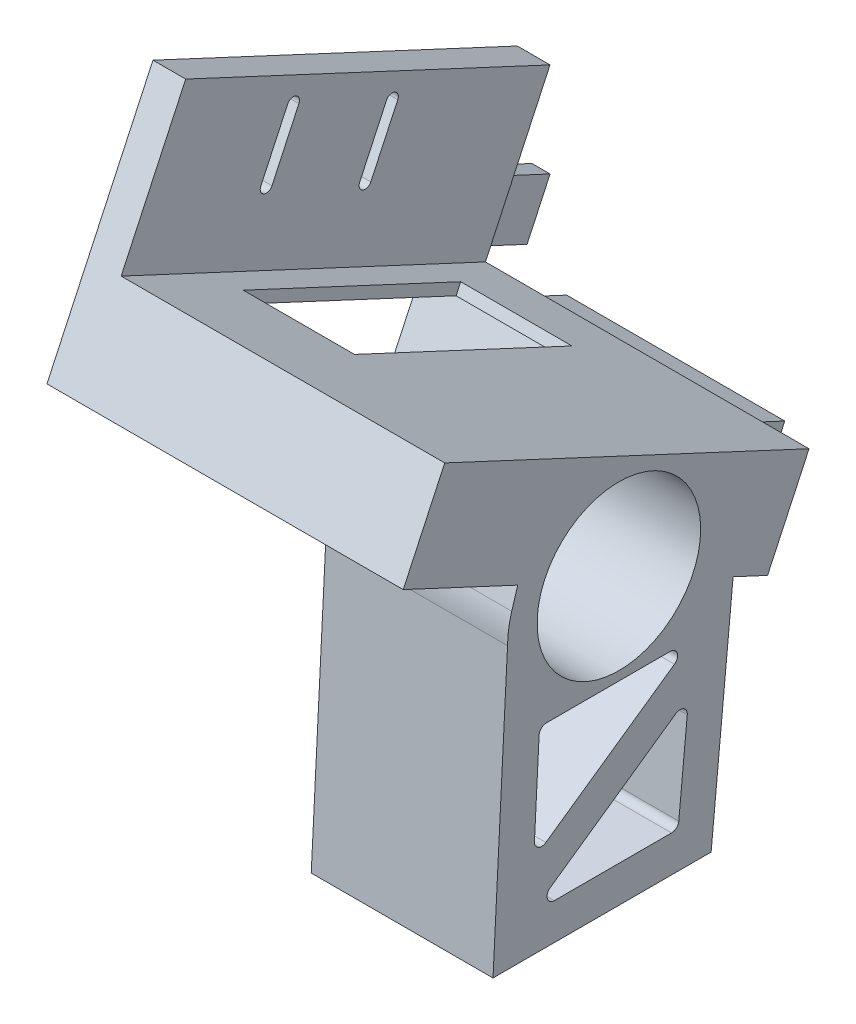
ISO-10303-21;
HEADER;
FILE_DESCRIPTION(('STEP AP214'),'2;1');
FILE_NAME('part.step','',(''),(''),'','','');
FILE_SCHEMA(('AUTOMOTIVE_DESIGN { 1 0 10303 214 1 1 1 1 }'));
ENDSEC;
DATA;
#1=APPLICATION_CONTEXT('core data for automotive mechanical design processes');
#2=APPLICATION_PROTOCOL_DEFINITION('international standard','automotive_design',2000,#1);
#3=PRODUCT_CONTEXT('',#1,'mechanical');
#4=PRODUCT('Part','Part','',(#3));
#5=PRODUCT_RELATED_PRODUCT_CATEGORY('part','',(#4));
#6=PRODUCT_DEFINITION_FORMATION('','',#4);
#7=PRODUCT_DEFINITION_CONTEXT('part definition',#1,'design');
#8=PRODUCT_DEFINITION('design','',#6,#7);
#9=PRODUCT_DEFINITION_SHAPE('','',#8);
#10=(LENGTH_UNIT() NAMED_UNIT(*) SI_UNIT(.MILLI.,.METRE.));
#11=(NAMED_UNIT(*) PLANE_ANGLE_UNIT() SI_UNIT($,.RADIAN.));
#12=(NAMED_UNIT(*) SI_UNIT($,.STERADIAN.) SOLID_ANGLE_UNIT());
#13=UNCERTAINTY_MEASURE_WITH_UNIT(LENGTH_MEASURE(1.E-05),#10,'distance_accuracy_value','');
#14=(GEOMETRIC_REPRESENTATION_CONTEXT(3) GLOBAL_UNCERTAINTY_ASSIGNED_CONTEXT((#13)) GLOBAL_UNIT_ASSIGNED_CONTEXT((#10,
#11,#12)) REPRESENTATION_CONTEXT('',''));
#15=CARTESIAN_POINT('',(0.,0.,0.));
#16=DIRECTION('',(0.,0.,1.));
#17=DIRECTION('',(1.,0.,0.));
#18=AXIS2_PLACEMENT_3D('',#15,#16,#17);
#19=CARTESIAN_POINT('',(-48.,2.73203183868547,-55.6623799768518));
#20=DIRECTION('',(-1.,0.,0.));
#21=DIRECTION('',(0.,0.,1.));
#22=AXIS2_PLACEMENT_3D('',#19,#20,#21);
#23=PLANE('',#22);
#24=DIRECTION('',(0.,0.906307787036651,-0.422618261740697));
#25=VECTOR('',#24,1.);
#26=CARTESIAN_POINT('',(-48.,49.4611221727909,44.5484776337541));
#27=LINE('',#26,#25);
#28=CARTESIAN_POINT('',(-48.,27.7097352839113,54.6913159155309));
#29=VERTEX_POINT('',#28);
#30=CARTESIAN_POINT('',(-48.,90.2449725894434,25.5306558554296));
#31=VERTEX_POINT('',#30);
#32=EDGE_CURVE('E731',#29,#31,#27,.T.);
#33=ORIENTED_EDGE('',*,*,#32,.T.);
#34=DIRECTION('',(0.,0.422618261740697,0.906307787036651));
#35=VECTOR('',#34,1.);
#36=CARTESIAN_POINT('',(-48.,64.3478528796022,-30.0058965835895));
#37=LINE('',#36,#35);
#38=CARTESIAN_POINT('',(-48.,43.515882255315,-74.6802017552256));
#39=VERTEX_POINT('',#38);
#40=EDGE_CURVE('E682',#39,#31,#37,.T.);
#41=ORIENTED_EDGE('',*,*,#40,.F.);
#42=DIRECTION('',(0.,0.906307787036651,-0.422618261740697));
#43=VECTOR('',#42,1.);
#44=CARTESIAN_POINT('',(-48.,2.73203183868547,-55.6623799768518));
#45=LINE('',#44,#43);
#46=CARTESIAN_POINT('',(-48.,-19.0193550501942,-45.5195416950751));
#47=VERTEX_POINT('',#46);
#48=EDGE_CURVE('E735',#47,#39,#45,.T.);
#49=ORIENTED_EDGE('',*,*,#48,.F.);
#50=DIRECTION('',(0.,-0.422618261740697,-0.906307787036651));
#51=VECTOR('',#50,1.);
#52=CARTESIAN_POINT('',(-48.,-19.0193550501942,-45.5195416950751));
#53=LINE('',#52,#51);
#54=CARTESIAN_POINT('',(-48.,-16.1517955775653,-39.3700405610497));
#55=VERTEX_POINT('',#54);
#56=EDGE_CURVE('E646',#55,#47,#53,.T.);
#57=ORIENTED_EDGE('',*,*,#56,.F.);
#58=DIRECTION('',(0.,0.906307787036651,-0.422618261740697));
#59=VECTOR('',#58,1.);
#60=CARTESIAN_POINT('',(-48.,-16.1517955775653,-39.3700405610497));
#61=LINE('',#60,#59);
#62=CARTESIAN_POINT('',(-48.,5.59959131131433,-49.5128788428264));
#63=VERTEX_POINT('',#62);
#64=EDGE_CURVE('E632',#55,#63,#61,.T.);
#65=ORIENTED_EDGE('',*,*,#64,.T.);
#66=DIRECTION('',(0.,0.422618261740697,0.906307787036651));
#67=VECTOR('',#66,1.);
#68=CARTESIAN_POINT('',(-48.,2.73203183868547,-55.6623799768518));
#69=LINE('',#68,#67);
#70=CARTESIAN_POINT('',(-48.,41.9447618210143,28.4295908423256));
#71=VERTEX_POINT('',#70);
#72=EDGE_CURVE('E729',#63,#71,#69,.T.);
#73=ORIENTED_EDGE('',*,*,#72,.T.);
#74=DIRECTION('',(0.,0.906307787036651,-0.422618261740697));
#75=VECTOR('',#74,1.);
#76=CARTESIAN_POINT('',(-48.,20.1933749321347,38.5724291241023));
#77=LINE('',#76,#75);
#78=CARTESIAN_POINT('',(-48.,20.1933749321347,38.5724291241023));
#79=VERTEX_POINT('',#78);
#80=EDGE_CURVE('E676',#79,#71,#77,.T.);
#81=ORIENTED_EDGE('',*,*,#80,.F.);
#82=DIRECTION('',(0.,-0.422618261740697,-0.906307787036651));
#83=VECTOR('',#82,1.);
#84=CARTESIAN_POINT('',(-48.,27.7097352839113,54.6913159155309));
#85=LINE('',#84,#83);
#86=EDGE_CURVE('E665',#29,#79,#85,.T.);
#87=ORIENTED_EDGE('',*,*,#86,.F.);
#88=EDGE_LOOP('',(#33,#41,#49,#57,#65,#73,#81,#87));
#89=FACE_BOUND('',#88,.T.);
#90=CARTESIAN_POINT('',(-48.,56.8692803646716,-31.2549872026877));
#91=DIRECTION('',(-1.,0.,0.));
#92=DIRECTION('',(0.,0.,1.));
#93=AXIS2_PLACEMENT_3D('',#90,#91,#92);
#94=CIRCLE('',#93,2.99999999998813);
#95=CARTESIAN_POINT('',(-48.,58.1371351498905,-28.5360638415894));
#96=VERTEX_POINT('',#95);
#97=CARTESIAN_POINT('',(-48.,55.6014255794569,-33.973910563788));
#98=VERTEX_POINT('',#97);
#99=EDGE_CURVE('E553',#96,#98,#94,.T.);
#100=ORIENTED_EDGE('',*,*,#99,.F.);
#101=DIRECTION('',(0.,-0.906307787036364,0.422618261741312));
#102=VECTOR('',#101,1.);
#103=CARTESIAN_POINT('',(-48.,58.1371351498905,-28.5360638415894));
#104=LINE('',#103,#102);
#105=CARTESIAN_POINT('',(-48.,42.276748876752,-21.1402442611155));
#106=VERTEX_POINT('',#105);
#107=EDGE_CURVE('E579',#96,#106,#104,.T.);
#108=ORIENTED_EDGE('',*,*,#107,.T.);
#109=CARTESIAN_POINT('',(-48.,41.0088940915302,-23.8591676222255));
#110=DIRECTION('',(-1.,0.,0.));
#111=DIRECTION('',(0.,0.,1.));
#112=AXIS2_PLACEMENT_3D('',#109,#110,#111);
#113=CIRCLE('',#112,3.);
#114=CARTESIAN_POINT('',(-48.,39.7410393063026,-26.5780909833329));
#115=VERTEX_POINT('',#114);
#116=EDGE_CURVE('E582',#115,#106,#113,.T.);
#117=ORIENTED_EDGE('',*,*,#116,.F.);
#118=DIRECTION('',(0.,-0.906307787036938,0.422618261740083));
#119=VECTOR('',#118,1.);
#120=CARTESIAN_POINT('',(-48.,55.6014255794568,-33.973910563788));
#121=LINE('',#120,#119);
#122=EDGE_CURVE('E586',#98,#115,#121,.T.);
#123=ORIENTED_EDGE('',*,*,#122,.F.);
#124=EDGE_LOOP('',(#100,#108,#117,#123));
#125=FACE_BOUND('',#124,.T.);
#126=CARTESIAN_POINT('',(-48.,69.5478282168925,-4.0657535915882));
#127=DIRECTION('',(-1.,0.,0.));
#128=DIRECTION('',(0.,0.,1.));
#129=AXIS2_PLACEMENT_3D('',#126,#127,#128);
#130=CIRCLE('',#129,2.99999999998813);
#131=CARTESIAN_POINT('',(-48.,70.8156830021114,-1.34683023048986));
#132=VERTEX_POINT('',#131);
#133=CARTESIAN_POINT('',(-48.,68.2799734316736,-6.78467695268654));
#134=VERTEX_POINT('',#133);
#135=EDGE_CURVE('E552',#132,#134,#130,.T.);
#136=ORIENTED_EDGE('',*,*,#135,.F.);
#137=DIRECTION('',(0.,-0.906307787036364,0.422618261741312));
#138=VECTOR('',#137,1.);
#139=CARTESIAN_POINT('',(-48.,12.1322537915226,26.0177022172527));
#140=LINE('',#139,#138);
#141=CARTESIAN_POINT('',(-48.,54.955296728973,6.04898934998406));
#142=VERTEX_POINT('',#141);
#143=EDGE_CURVE('E549',#132,#142,#140,.T.);
#144=ORIENTED_EDGE('',*,*,#143,.T.);
#145=CARTESIAN_POINT('',(-48.,53.6874419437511,3.330065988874));
#146=DIRECTION('',(-1.,0.,0.));
#147=DIRECTION('',(0.,0.,1.));
#148=AXIS2_PLACEMENT_3D('',#145,#146,#147);
#149=CIRCLE('',#148,3.);
#150=CARTESIAN_POINT('',(-48.,52.4195871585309,0.611142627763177));
#151=VERTEX_POINT('',#150);
#152=EDGE_CURVE('E529',#151,#142,#149,.T.);
#153=ORIENTED_EDGE('',*,*,#152,.F.);
#154=DIRECTION('',(0.,-0.906307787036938,0.422618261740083));
#155=VECTOR('',#154,1.);
#156=CARTESIAN_POINT('',(-48.,9.59654422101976,20.5798554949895));
#157=LINE('',#156,#155);
#158=EDGE_CURVE('E556',#134,#151,#157,.T.);
#159=ORIENTED_EDGE('',*,*,#158,.F.);
#160=EDGE_LOOP('',(#136,#144,#153,#159));
#161=FACE_BOUND('',#160,.T.);
#162=ADVANCED_FACE('F68',(#89,#125,#161),#23,.T.);
#163=CARTESIAN_POINT('',(50.,10.1459479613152,21.7580556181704));
#164=DIRECTION('',(0.,-0.422618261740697,-0.906307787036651));
#165=DIRECTION('',(0.,0.906307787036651,-0.422618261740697));
#166=AXIS2_PLACEMENT_3D('',#163,#164,#165);
#167=PLANE('',#166);
#168=DIRECTION('',(0.,-0.906307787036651,0.422618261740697));
#169=VECTOR('',#168,1.);
#170=CARTESIAN_POINT('',(-44.,10.1459479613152,21.7580556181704));
#171=LINE('',#170,#169);
#172=CARTESIAN_POINT('',(-44.,68.8293771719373,-5.60647682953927));
#173=VERTEX_POINT('',#172);
#174=CARTESIAN_POINT('',(-44.,52.968990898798,1.78934275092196));
#175=VERTEX_POINT('',#174);
#176=EDGE_CURVE('E528',#173,#175,#171,.T.);
#177=ORIENTED_EDGE('',*,*,#176,.T.);
#178=DIRECTION('',(-1.,0.,0.));
#179=VECTOR('',#178,1.);
#180=CARTESIAN_POINT('',(50.,52.968990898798,1.78934275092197));
#181=LINE('',#180,#179);
#182=CARTESIAN_POINT('',(-39.,52.968990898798,1.78934275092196));
#183=VERTEX_POINT('',#182);
#184=EDGE_CURVE('E605',#183,#175,#181,.T.);
#185=ORIENTED_EDGE('',*,*,#184,.F.);
#186=DIRECTION('',(0.,-0.906307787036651,0.422618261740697));
#187=VECTOR('',#186,1.);
#188=CARTESIAN_POINT('',(-39.,74.4938008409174,-8.24784096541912));
#189=LINE('',#188,#187);
#190=CARTESIAN_POINT('',(-39.,68.8293771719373,-5.60647682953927));
#191=VERTEX_POINT('',#190);
#192=EDGE_CURVE('E817',#191,#183,#189,.T.);
#193=ORIENTED_EDGE('',*,*,#192,.F.);
#194=DIRECTION('',(-1.,0.,0.));
#195=VECTOR('',#194,1.);
#196=CARTESIAN_POINT('',(50.,68.8293771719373,-5.60647682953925));
#197=LINE('',#196,#195);
#198=EDGE_CURVE('E619',#191,#173,#197,.T.);
#199=ORIENTED_EDGE('',*,*,#198,.T.);
#200=EDGE_LOOP('',(#177,#185,#193,#199));
#201=FACE_BOUND('',#200,.T.);
#202=ADVANCED_FACE('F928',(#201),#167,.F.);
#203=CARTESIAN_POINT('',(50.,69.5478282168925,-4.06575359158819));
#204=DIRECTION('',(-1.,0.,0.));
#205=DIRECTION('',(0.,0.,1.));
#206=AXIS2_PLACEMENT_3D('',#203,#204,#205);
#207=CYLINDRICAL_SURFACE('',#206,1.69999999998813);
#208=CARTESIAN_POINT('',(-44.,69.5478282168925,-4.0657535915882));
#209=DIRECTION('',(-1.,0.,0.));
#210=DIRECTION('',(0.,0.,1.));
#211=AXIS2_PLACEMENT_3D('',#208,#209,#210);
#212=CIRCLE('',#211,1.69999999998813);
#213=CARTESIAN_POINT('',(-44.,70.2662792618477,-2.52503035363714));
#214=VERTEX_POINT('',#213);
#215=EDGE_CURVE('E532',#214,#173,#212,.T.);
#216=ORIENTED_EDGE('',*,*,#215,.T.);
#217=ORIENTED_EDGE('',*,*,#198,.F.);
#218=CARTESIAN_POINT('',(-39.,69.5478282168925,-4.0657535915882));
#219=DIRECTION('',(-1.,0.,0.));
#220=DIRECTION('',(0.,0.,1.));
#221=AXIS2_PLACEMENT_3D('',#218,#219,#220);
#222=CIRCLE('',#221,1.69999999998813);
#223=CARTESIAN_POINT('',(-39.,70.2662792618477,-2.52503035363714));
#224=VERTEX_POINT('',#223);
#225=EDGE_CURVE('E814',#224,#191,#222,.T.);
#226=ORIENTED_EDGE('',*,*,#225,.F.);
#227=DIRECTION('',(-1.,0.,0.));
#228=VECTOR('',#227,1.);
#229=CARTESIAN_POINT('',(50.,70.2662792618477,-2.52503035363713));
#230=LINE('',#229,#228);
#231=EDGE_CURVE('E622',#224,#214,#230,.T.);
#232=ORIENTED_EDGE('',*,*,#231,.T.);
#233=EDGE_LOOP('',(#216,#217,#226,#232));
#234=FACE_BOUND('',#233,.T.);
#235=ADVANCED_FACE('F935',(#234),#207,.F.);
#236=CARTESIAN_POINT('',(50.,11.5828500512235,24.8395020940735));
#237=DIRECTION('',(0.,-0.422618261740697,-0.906307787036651));
#238=DIRECTION('',(0.,0.906307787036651,-0.422618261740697));
#239=AXIS2_PLACEMENT_3D('',#236,#237,#238);
#240=PLANE('',#239);
#241=DIRECTION('',(-1.,0.,0.));
#242=VECTOR('',#241,1.);
#243=CARTESIAN_POINT('',(50.,54.4058929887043,4.87078922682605));
#244=LINE('',#243,#242);
#245=CARTESIAN_POINT('',(-39.,54.4058929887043,4.87078922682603));
#246=VERTEX_POINT('',#245);
#247=CARTESIAN_POINT('',(-44.,54.4058929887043,4.87078922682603));
#248=VERTEX_POINT('',#247);
#249=EDGE_CURVE('E625',#246,#248,#244,.T.);
#250=ORIENTED_EDGE('',*,*,#249,.T.);
#251=DIRECTION('',(0.,-0.906307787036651,0.422618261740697));
#252=VECTOR('',#251,1.);
#253=CARTESIAN_POINT('',(-44.,11.5828500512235,24.8395020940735));
#254=LINE('',#253,#252);
#255=EDGE_CURVE('E535',#214,#248,#254,.T.);
#256=ORIENTED_EDGE('',*,*,#255,.F.);
#257=ORIENTED_EDGE('',*,*,#231,.F.);
#258=DIRECTION('',(0.,-0.906307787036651,0.422618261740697));
#259=VECTOR('',#258,1.);
#260=CARTESIAN_POINT('',(-39.,75.9307029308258,-5.16639448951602));
#261=LINE('',#260,#259);
#262=EDGE_CURVE('E811',#224,#246,#261,.T.);
#263=ORIENTED_EDGE('',*,*,#262,.T.);
#264=EDGE_LOOP('',(#250,#256,#257,#263));
#265=FACE_BOUND('',#264,.T.);
#266=ADVANCED_FACE('F1109',(#265),#240,.T.);
#267=CARTESIAN_POINT('',(50.,53.6874419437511,3.33006598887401));
#268=DIRECTION('',(-1.,0.,0.));
#269=DIRECTION('',(0.,0.,1.));
#270=AXIS2_PLACEMENT_3D('',#267,#268,#269);
#271=CYLINDRICAL_SURFACE('',#270,1.69999999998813);
#272=CARTESIAN_POINT('',(-44.,53.6874419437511,3.330065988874));
#273=DIRECTION('',(-1.,0.,0.));
#274=DIRECTION('',(0.,0.,1.));
#275=AXIS2_PLACEMENT_3D('',#272,#273,#274);
#276=CIRCLE('',#275,1.69999999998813);
#277=EDGE_CURVE('E525',#175,#248,#276,.T.);
#278=ORIENTED_EDGE('',*,*,#277,.T.);
#279=ORIENTED_EDGE('',*,*,#249,.F.);
#280=CARTESIAN_POINT('',(-39.,53.6874419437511,3.330065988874));
#281=DIRECTION('',(-1.,0.,0.));
#282=DIRECTION('',(0.,0.,1.));
#283=AXIS2_PLACEMENT_3D('',#280,#281,#282);
#284=CIRCLE('',#283,1.69999999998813);
#285=EDGE_CURVE('E789',#183,#246,#284,.T.);
#286=ORIENTED_EDGE('',*,*,#285,.F.);
#287=ORIENTED_EDGE('',*,*,#184,.T.);
#288=EDGE_LOOP('',(#278,#279,#286,#287));
#289=FACE_BOUND('',#288,.T.);
#290=ADVANCED_FACE('F1105',(#289),#271,.F.);
#291=CARTESIAN_POINT('',(50.,-2.53259989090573,-5.43117799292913));
#292=DIRECTION('',(0.,-0.422618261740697,-0.906307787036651));
#293=DIRECTION('',(0.,0.906307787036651,-0.422618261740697));
#294=AXIS2_PLACEMENT_3D('',#291,#292,#293);
#295=PLANE('',#294);
#296=DIRECTION('',(0.,0.906307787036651,-0.422618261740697));
#297=VECTOR('',#296,1.);
#298=CARTESIAN_POINT('',(-44.,-2.53259989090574,-5.43117799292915));
#299=LINE('',#298,#297);
#300=CARTESIAN_POINT('',(-44.,40.2904430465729,-25.3998908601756));
#301=VERTEX_POINT('',#300);
#302=CARTESIAN_POINT('',(-44.,56.1508293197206,-32.7957104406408));
#303=VERTEX_POINT('',#302);
#304=EDGE_CURVE('E603',#301,#303,#299,.T.);
#305=ORIENTED_EDGE('',*,*,#304,.F.);
#306=DIRECTION('',(-1.,0.,0.));
#307=VECTOR('',#306,1.);
#308=CARTESIAN_POINT('',(50.,40.2904430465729,-25.3998908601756));
#309=LINE('',#308,#307);
#310=CARTESIAN_POINT('',(-39.,40.2904430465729,-25.3998908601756));
#311=VERTEX_POINT('',#310);
#312=EDGE_CURVE('E616',#311,#301,#309,.T.);
#313=ORIENTED_EDGE('',*,*,#312,.F.);
#314=DIRECTION('',(0.,-0.906307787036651,0.422618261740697));
#315=VECTOR('',#314,1.);
#316=CARTESIAN_POINT('',(-39.,61.8152529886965,-35.4370745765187));
#317=LINE('',#316,#315);
#318=CARTESIAN_POINT('',(-39.,56.1508293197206,-32.7957104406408));
#319=VERTEX_POINT('',#318);
#320=EDGE_CURVE('E829',#319,#311,#317,.T.);
#321=ORIENTED_EDGE('',*,*,#320,.F.);
#322=DIRECTION('',(-1.,0.,0.));
#323=VECTOR('',#322,1.);
#324=CARTESIAN_POINT('',(50.,56.1508293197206,-32.7957104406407));
#325=LINE('',#324,#323);
#326=EDGE_CURVE('E606',#319,#303,#325,.T.);
#327=ORIENTED_EDGE('',*,*,#326,.T.);
#328=EDGE_LOOP('',(#305,#313,#321,#327));
#329=FACE_BOUND('',#328,.T.);
#330=ADVANCED_FACE('F1094',(#329),#295,.F.);
#331=CARTESIAN_POINT('',(50.,56.8692803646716,-31.2549872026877));
#332=DIRECTION('',(-1.,0.,0.));
#333=DIRECTION('',(0.,0.,1.));
#334=AXIS2_PLACEMENT_3D('',#331,#332,#333);
#335=CYLINDRICAL_SURFACE('',#334,1.69999999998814);
#336=CARTESIAN_POINT('',(-44.,56.8692803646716,-31.2549872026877));
#337=DIRECTION('',(-1.,0.,0.));
#338=DIRECTION('',(0.,0.,1.));
#339=AXIS2_PLACEMENT_3D('',#336,#337,#338);
#340=CIRCLE('',#339,1.69999999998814);
#341=CARTESIAN_POINT('',(-44.,57.5877314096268,-29.7142639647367));
#342=VERTEX_POINT('',#341);
#343=EDGE_CURVE('E601',#303,#342,#340,.F.);
#344=ORIENTED_EDGE('',*,*,#343,.F.);
#345=ORIENTED_EDGE('',*,*,#326,.F.);
#346=CARTESIAN_POINT('',(-39.,56.8692803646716,-31.2549872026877));
#347=DIRECTION('',(-1.,0.,0.));
#348=DIRECTION('',(0.,0.,1.));
#349=AXIS2_PLACEMENT_3D('',#346,#347,#348);
#350=CIRCLE('',#349,1.69999999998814);
#351=CARTESIAN_POINT('',(-39.,57.5877314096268,-29.7142639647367));
#352=VERTEX_POINT('',#351);
#353=EDGE_CURVE('E826',#352,#319,#350,.T.);
#354=ORIENTED_EDGE('',*,*,#353,.F.);
#355=DIRECTION('',(-1.,0.,0.));
#356=VECTOR('',#355,1.);
#357=CARTESIAN_POINT('',(50.,57.5877314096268,-29.7142639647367));
#358=LINE('',#357,#356);
#359=EDGE_CURVE('E610',#352,#342,#358,.T.);
#360=ORIENTED_EDGE('',*,*,#359,.T.);
#361=EDGE_LOOP('',(#344,#345,#354,#360));
#362=FACE_BOUND('',#361,.T.);
#363=ADVANCED_FACE('F1090',(#362),#335,.F.);
#364=CARTESIAN_POINT('',(50.,-1.09569780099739,-2.34973151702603));
#365=DIRECTION('',(0.,-0.422618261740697,-0.906307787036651));
#366=DIRECTION('',(0.,0.906307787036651,-0.422618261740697));
#367=AXIS2_PLACEMENT_3D('',#364,#365,#366);
#368=PLANE('',#367);
#369=DIRECTION('',(-1.,0.,0.));
#370=VECTOR('',#369,1.);
#371=CARTESIAN_POINT('',(50.,41.7273451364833,-22.3184443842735));
#372=LINE('',#371,#370);
#373=CARTESIAN_POINT('',(-39.,41.7273451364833,-22.3184443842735));
#374=VERTEX_POINT('',#373);
#375=CARTESIAN_POINT('',(-44.,41.7273451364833,-22.3184443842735));
#376=VERTEX_POINT('',#375);
#377=EDGE_CURVE('E613',#374,#376,#372,.T.);
#378=ORIENTED_EDGE('',*,*,#377,.T.);
#379=DIRECTION('',(0.,0.906307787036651,-0.422618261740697));
#380=VECTOR('',#379,1.);
#381=CARTESIAN_POINT('',(-44.,-1.0956978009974,-2.34973151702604));
#382=LINE('',#381,#380);
#383=EDGE_CURVE('E563',#376,#342,#382,.T.);
#384=ORIENTED_EDGE('',*,*,#383,.T.);
#385=ORIENTED_EDGE('',*,*,#359,.F.);
#386=DIRECTION('',(0.,-0.906307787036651,0.422618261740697));
#387=VECTOR('',#386,1.);
#388=CARTESIAN_POINT('',(-39.,63.2521550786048,-32.3556281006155));
#389=LINE('',#388,#387);
#390=EDGE_CURVE('E823',#352,#374,#389,.T.);
#391=ORIENTED_EDGE('',*,*,#390,.T.);
#392=EDGE_LOOP('',(#378,#384,#385,#391));
#393=FACE_BOUND('',#392,.T.);
#394=ADVANCED_FACE('F1093',(#393),#368,.T.);
#395=CARTESIAN_POINT('',(50.,41.0088940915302,-23.8591676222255));
#396=DIRECTION('',(-1.,0.,0.));
#397=DIRECTION('',(0.,0.,1.));
#398=AXIS2_PLACEMENT_3D('',#395,#396,#397);
#399=CYLINDRICAL_SURFACE('',#398,1.69999999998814);
#400=CARTESIAN_POINT('',(-44.,41.0088940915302,-23.8591676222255));
#401=DIRECTION('',(-1.,0.,0.));
#402=DIRECTION('',(0.,0.,1.));
#403=AXIS2_PLACEMENT_3D('',#400,#401,#402);
#404=CIRCLE('',#403,1.69999999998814);
#405=EDGE_CURVE('E832',#376,#301,#404,.F.);
#406=ORIENTED_EDGE('',*,*,#405,.F.);
#407=ORIENTED_EDGE('',*,*,#377,.F.);
#408=CARTESIAN_POINT('',(-39.,41.0088940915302,-23.8591676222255));
#409=DIRECTION('',(-1.,0.,0.));
#410=DIRECTION('',(0.,0.,1.));
#411=AXIS2_PLACEMENT_3D('',#408,#409,#410);
#412=CIRCLE('',#411,1.69999999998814);
#413=EDGE_CURVE('E820',#311,#374,#412,.T.);
#414=ORIENTED_EDGE('',*,*,#413,.F.);
#415=ORIENTED_EDGE('',*,*,#312,.T.);
#416=EDGE_LOOP('',(#406,#407,#414,#415));
#417=FACE_BOUND('',#416,.T.);
#418=ADVANCED_FACE('F1098',(#417),#399,.F.);
#419=CARTESIAN_POINT('',(0.,23.5640024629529,-10.9880748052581));
#420=DIRECTION('',(0.,0.906307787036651,-0.422618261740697));
#421=DIRECTION('',(0.,0.422618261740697,0.906307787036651));
#422=AXIS2_PLACEMENT_3D('',#419,#420,#421);
#423=PLANE('',#422);
#424=DIRECTION('',(0.,-0.422618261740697,-0.906307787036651));
#425=VECTOR('',#424,1.);
#426=CARTESIAN_POINT('',(0.,5.59959131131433,-49.5128788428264));
#427=LINE('',#426,#425);
#428=CARTESIAN_POINT('',(0.,9.82577392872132,-40.4498009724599));
#429=VERTEX_POINT('',#428);
#430=CARTESIAN_POINT('',(0.,5.59959131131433,-49.5128788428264));
#431=VERTEX_POINT('',#430);
#432=EDGE_CURVE('E638',#429,#431,#427,.T.);
#433=ORIENTED_EDGE('',*,*,#432,.F.);
#434=DIRECTION('',(-1.,0.,0.));
#435=VECTOR('',#434,1.);
#436=CARTESIAN_POINT('',(-30.6,9.82577392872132,-40.4498009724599));
#437=LINE('',#436,#435);
#438=CARTESIAN_POINT('',(-30.6,9.82577392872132,-40.4498009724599));
#439=VERTEX_POINT('',#438);
#440=EDGE_CURVE('E708',#429,#439,#437,.T.);
#441=ORIENTED_EDGE('',*,*,#440,.T.);
#442=DIRECTION('',(0.,0.422618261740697,0.906307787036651));
#443=VECTOR('',#442,1.);
#444=CARTESIAN_POINT('',(-30.6,9.82577392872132,-40.4498009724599));
#445=LINE('',#444,#443);
#446=CARTESIAN_POINT('',(-30.6,37.7185792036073,19.3665129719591));
#447=VERTEX_POINT('',#446);
#448=EDGE_CURVE('E701',#439,#447,#445,.T.);
#449=ORIENTED_EDGE('',*,*,#448,.T.);
#450=DIRECTION('',(1.,0.,0.));
#451=VECTOR('',#450,1.);
#452=CARTESIAN_POINT('',(-30.6,37.7185792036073,19.3665129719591));
#453=LINE('',#452,#451);
#454=CARTESIAN_POINT('',(0.,37.7185792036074,19.3665129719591));
#455=VERTEX_POINT('',#454);
#456=EDGE_CURVE('E704',#447,#455,#453,.T.);
#457=ORIENTED_EDGE('',*,*,#456,.T.);
#458=DIRECTION('',(0.,-0.422618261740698,-0.906307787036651));
#459=VECTOR('',#458,1.);
#460=CARTESIAN_POINT('',(0.,41.9447618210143,28.4295908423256));
#461=LINE('',#460,#459);
#462=CARTESIAN_POINT('',(0.,41.9447618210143,28.4295908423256));
#463=VERTEX_POINT('',#462);
#464=EDGE_CURVE('E654',#463,#455,#461,.T.);
#465=ORIENTED_EDGE('',*,*,#464,.F.);
#466=DIRECTION('',(1.,0.,0.));
#467=VECTOR('',#466,1.);
#468=CARTESIAN_POINT('',(-48.,41.9447618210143,28.4295908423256));
#469=LINE('',#468,#467);
#470=EDGE_CURVE('E659',#71,#463,#469,.T.);
#471=ORIENTED_EDGE('',*,*,#470,.F.);
#472=ORIENTED_EDGE('',*,*,#72,.F.);
#473=DIRECTION('',(-1.,0.,0.));
#474=VECTOR('',#473,1.);
#475=CARTESIAN_POINT('',(-48.,5.59959131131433,-49.5128788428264));
#476=LINE('',#475,#474);
#477=EDGE_CURVE('E636',#431,#63,#476,.T.);
#478=ORIENTED_EDGE('',*,*,#477,.F.);
#479=EDGE_LOOP('',(#433,#441,#449,#457,#465,#471,#472,#478));
#480=FACE_BOUND('',#479,.T.);
#481=ADVANCED_FACE('F955',(#480),#423,.F.);
#482=CARTESIAN_POINT('',(50.,11.7917623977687,-38.5999266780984));
#483=DIRECTION('',(0.,-0.0962345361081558,-0.995358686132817));
#484=DIRECTION('',(0.,0.995358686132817,-0.0962345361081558));
#485=AXIS2_PLACEMENT_3D('',#482,#483,#484);
#486=PLANE('',#485);
#487=DIRECTION('',(0.,-0.995358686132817,0.0962345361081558));
#488=VECTOR('',#487,1.);
#489=CARTESIAN_POINT('',(0.,11.7917623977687,-38.5999266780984));
#490=LINE('',#489,#488);
#491=CARTESIAN_POINT('',(0.,-14.6027130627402,-36.0480223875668));
#492=VERTEX_POINT('',#491);
#493=CARTESIAN_POINT('',(0.,-77.1577152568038,-30.));
#494=VERTEX_POINT('',#493);
#495=EDGE_CURVE('E747',#492,#494,#490,.T.);
#496=ORIENTED_EDGE('',*,*,#495,.F.);
#497=DIRECTION('',(1.,0.,0.));
#498=VECTOR('',#497,1.);
#499=CARTESIAN_POINT('',(50.,-14.6027130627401,-36.0480223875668));
#500=LINE('',#499,#498);
#501=CARTESIAN_POINT('',(50.,-14.6027130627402,-36.0480223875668));
#502=VERTEX_POINT('',#501);
#503=EDGE_CURVE('E641',#492,#502,#500,.T.);
#504=ORIENTED_EDGE('',*,*,#503,.T.);
#505=DIRECTION('',(0.,-0.995358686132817,0.0962345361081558));
#506=VECTOR('',#505,1.);
#507=CARTESIAN_POINT('',(50.,11.7917623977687,-38.5999266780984));
#508=LINE('',#507,#506);
#509=CARTESIAN_POINT('',(50.,-77.1577152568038,-30.));
#510=VERTEX_POINT('',#509);
#511=EDGE_CURVE('E750',#502,#510,#508,.T.);
#512=ORIENTED_EDGE('',*,*,#511,.T.);
#513=DIRECTION('',(-1.,0.,0.));
#514=VECTOR('',#513,1.);
#515=CARTESIAN_POINT('',(50.,-77.1577152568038,-30.));
#516=LINE('',#515,#514);
#517=EDGE_CURVE('E768',#510,#494,#516,.T.);
#518=ORIENTED_EDGE('',*,*,#517,.T.);
#519=EDGE_LOOP('',(#496,#504,#512,#518));
#520=FACE_BOUND('',#519,.T.);
#521=ADVANCED_FACE('F947',(#520),#486,.T.);
#522=CARTESIAN_POINT('',(-61.7661939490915,39.0788794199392,15.1850814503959));
#523=DIRECTION('',(0.,0.906307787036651,-0.422618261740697));
#524=DIRECTION('',(0.,0.422618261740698,0.906307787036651));
#525=AXIS2_PLACEMENT_3D('',#522,#523,#524);
#526=PLANE('',#525);
#527=DIRECTION('',(0.,-0.422618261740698,-0.906307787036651));
#528=VECTOR('',#527,1.);
#529=CARTESIAN_POINT('',(0.,39.0788794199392,15.1850814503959));
#530=LINE('',#529,#528);
#531=CARTESIAN_POINT('',(0.,40.4375025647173,18.098658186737));
#532=VERTEX_POINT('',#531);
#533=CARTESIAN_POINT('',(0.,12.5446972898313,-41.717655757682));
#534=VERTEX_POINT('',#533);
#535=EDGE_CURVE('E745',#532,#534,#530,.T.);
#536=ORIENTED_EDGE('',*,*,#535,.F.);
#537=DIRECTION('',(1.,0.,0.));
#538=VECTOR('',#537,1.);
#539=CARTESIAN_POINT('',(-30.6,40.4375025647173,18.098658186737));
#540=LINE('',#539,#538);
#541=CARTESIAN_POINT('',(-30.6,40.4375025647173,18.098658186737));
#542=VERTEX_POINT('',#541);
#543=EDGE_CURVE('E713',#542,#532,#540,.T.);
#544=ORIENTED_EDGE('',*,*,#543,.F.);
#545=DIRECTION('',(0.,0.422618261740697,0.906307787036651));
#546=VECTOR('',#545,1.);
#547=CARTESIAN_POINT('',(-30.6,12.5446972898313,-41.717655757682));
#548=LINE('',#547,#546);
#549=CARTESIAN_POINT('',(-30.6,12.5446972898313,-41.717655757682));
#550=VERTEX_POINT('',#549);
#551=EDGE_CURVE('E700',#550,#542,#548,.T.);
#552=ORIENTED_EDGE('',*,*,#551,.F.);
#553=DIRECTION('',(-1.,0.,0.));
#554=VECTOR('',#553,1.);
#555=CARTESIAN_POINT('',(-30.6,12.5446972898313,-41.717655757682));
#556=LINE('',#555,#554);
#557=EDGE_CURVE('E705',#534,#550,#556,.T.);
#558=ORIENTED_EDGE('',*,*,#557,.F.);
#559=EDGE_LOOP('',(#536,#544,#552,#558));
#560=FACE_BOUND('',#559,.T.);
#561=DIRECTION('',(-1.,0.,0.));
#562=VECTOR('',#561,1.);
#563=CARTESIAN_POINT('',(-48.,5.45095519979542,-56.9302347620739));
#564=LINE('',#563,#562);
#565=CARTESIAN_POINT('',(50.,5.45095519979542,-56.9302347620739));
#566=VERTEX_POINT('',#565);
#567=CARTESIAN_POINT('',(-39.,5.45095519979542,-56.9302347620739));
#568=VERTEX_POINT('',#567);
#569=EDGE_CURVE('E732',#566,#568,#564,.T.);
#570=ORIENTED_EDGE('',*,*,#569,.T.);
#571=DIRECTION('',(0.,0.422618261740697,0.906307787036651));
#572=VECTOR('',#571,1.);
#573=CARTESIAN_POINT('',(-39.,39.0788794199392,15.1850814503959));
#574=LINE('',#573,#572);
#575=CARTESIAN_POINT('',(-39.,52.1800455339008,43.280622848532));
#576=VERTEX_POINT('',#575);
#577=EDGE_CURVE('E698',#568,#576,#574,.T.);
#578=ORIENTED_EDGE('',*,*,#577,.T.);
#579=DIRECTION('',(1.,0.,0.));
#580=VECTOR('',#579,1.);
#581=CARTESIAN_POINT('',(-48.,52.1800455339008,43.280622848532));
#582=LINE('',#581,#580);
#583=CARTESIAN_POINT('',(50.,52.1800455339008,43.280622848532));
#584=VERTEX_POINT('',#583);
#585=EDGE_CURVE('E720',#576,#584,#582,.T.);
#586=ORIENTED_EDGE('',*,*,#585,.T.);
#587=DIRECTION('',(0.,0.422618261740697,0.906307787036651));
#588=VECTOR('',#587,1.);
#589=CARTESIAN_POINT('',(50.,39.0788794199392,15.1850814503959));
#590=LINE('',#589,#588);
#591=EDGE_CURVE('E737',#566,#584,#590,.T.);
#592=ORIENTED_EDGE('',*,*,#591,.F.);
#593=EDGE_LOOP('',(#570,#578,#586,#592));
#594=FACE_BOUND('',#593,.T.);
#595=ADVANCED_FACE('F943',(#560,#594),#526,.T.);
#596=CARTESIAN_POINT('',(50.,37.1488581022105,15.7785405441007));
#597=DIRECTION('',(0.,0.293907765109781,0.955833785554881));
#598=DIRECTION('',(0.,-0.955833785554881,0.293907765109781));
#599=AXIS2_PLACEMENT_3D('',#596,#597,#598);
#600=PLANE('',#599);
#601=DIRECTION('',(1.,0.,0.));
#602=VECTOR('',#601,1.);
#603=CARTESIAN_POINT('',(50.,13.0235916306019,23.1967792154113));
#604=LINE('',#603,#602);
#605=CARTESIAN_POINT('',(0.,13.0235916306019,23.1967792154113));
#606=VERTEX_POINT('',#605);
#607=CARTESIAN_POINT('',(50.,13.0235916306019,23.1967792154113));
#608=VERTEX_POINT('',#607);
#609=EDGE_CURVE('E679',#606,#608,#604,.T.);
#610=ORIENTED_EDGE('',*,*,#609,.F.);
#611=DIRECTION('',(0.,0.955833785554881,-0.293907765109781));
#612=VECTOR('',#611,1.);
#613=CARTESIAN_POINT('',(0.,37.1488581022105,15.7785405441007));
#614=LINE('',#613,#612);
#615=CARTESIAN_POINT('',(0.,7.6416018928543,24.8516784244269));
#616=VERTEX_POINT('',#615);
#617=EDGE_CURVE('E753',#616,#606,#614,.T.);
#618=ORIENTED_EDGE('',*,*,#617,.F.);
#619=DIRECTION('',(-1.,0.,0.));
#620=VECTOR('',#619,1.);
#621=CARTESIAN_POINT('',(50.,7.6416018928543,24.8516784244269));
#622=LINE('',#621,#620);
#623=CARTESIAN_POINT('',(50.,7.6416018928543,24.8516784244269));
#624=VERTEX_POINT('',#623);
#625=EDGE_CURVE('E755',#624,#616,#622,.T.);
#626=ORIENTED_EDGE('',*,*,#625,.F.);
#627=DIRECTION('',(0.,0.955833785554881,-0.293907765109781));
#628=VECTOR('',#627,1.);
#629=CARTESIAN_POINT('',(50.,37.1488581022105,15.7785405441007));
#630=LINE('',#629,#628);
#631=EDGE_CURVE('E752',#624,#608,#630,.T.);
#632=ORIENTED_EDGE('',*,*,#631,.T.);
#633=EDGE_LOOP('',(#610,#618,#626,#632));
#634=FACE_BOUND('',#633,.T.);
#635=ADVANCED_FACE('F946',(#634),#600,.T.);
#636=CARTESIAN_POINT('',(4.8,0.,0.));
#637=DIRECTION('',(1.,0.,0.));
#638=DIRECTION('',(0.,0.,-1.));
#639=AXIS2_PLACEMENT_3D('',#636,#637,#638);
#640=PLANE('',#639);
#641=CARTESIAN_POINT('',(4.8,1.23668257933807,-19.1289719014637));
#642=DIRECTION('',(1.,0.,0.));
#643=DIRECTION('',(0.,0.,-1.));
#644=AXIS2_PLACEMENT_3D('',#641,#642,#643);
#645=CIRCLE('',#644,2.5);
#646=CARTESIAN_POINT('',(4.8,1.23668257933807,-21.6289719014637));
#647=VERTEX_POINT('',#646);
#648=EDGE_CURVE('E793',#647,#647,#645,.T.);
#649=ORIENTED_EDGE('',*,*,#648,.F.);
#650=EDGE_LOOP('',(#649));
#651=FACE_BOUND('',#650,.T.);
#652=CARTESIAN_POINT('',(4.8,1.23668257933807,-4.62897190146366));
#653=DIRECTION('',(1.,0.,0.));
#654=DIRECTION('',(0.,0.,-1.));
#655=AXIS2_PLACEMENT_3D('',#652,#653,#654);
#656=CIRCLE('',#655,22.5);
#657=CARTESIAN_POINT('',(4.8,1.23668257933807,-27.1289719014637));
#658=VERTEX_POINT('',#657);
#659=EDGE_CURVE('E783',#658,#658,#656,.F.);
#660=ORIENTED_EDGE('',*,*,#659,.F.);
#661=EDGE_LOOP('',(#660));
#662=FACE_BOUND('',#661,.T.);
#663=CARTESIAN_POINT('',(4.8,1.23668257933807,9.87102809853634));
#664=DIRECTION('',(1.,0.,0.));
#665=DIRECTION('',(0.,0.,-1.));
#666=AXIS2_PLACEMENT_3D('',#663,#664,#665);
#667=CIRCLE('',#666,2.5);
#668=CARTESIAN_POINT('',(4.8,1.23668257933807,7.37102809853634));
#669=VERTEX_POINT('',#668);
#670=EDGE_CURVE('E786',#669,#669,#667,.T.);
#671=ORIENTED_EDGE('',*,*,#670,.F.);
#672=EDGE_LOOP('',(#671));
#673=FACE_BOUND('',#672,.T.);
#674=CARTESIAN_POINT('',(4.8,1.23668257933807,-4.62897190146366));
#675=DIRECTION('',(1.,0.,0.));
#676=DIRECTION('',(0.,0.,-1.));
#677=AXIS2_PLACEMENT_3D('',#674,#675,#676);
#678=CIRCLE('',#677,10.);
#679=CARTESIAN_POINT('',(4.8,1.23668257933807,-14.6289719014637));
#680=VERTEX_POINT('',#679);
#681=EDGE_CURVE('E799',#680,#680,#678,.T.);
#682=ORIENTED_EDGE('',*,*,#681,.F.);
#683=EDGE_LOOP('',(#682));
#684=FACE_BOUND('',#683,.T.);
#685=ADVANCED_FACE('F951',(#651,#662,#673,#684),#640,.T.);
#686=CARTESIAN_POINT('',(0.,0.,0.));
#687=DIRECTION('',(1.,0.,0.));
#688=DIRECTION('',(0.,0.,-1.));
#689=AXIS2_PLACEMENT_3D('',#686,#687,#688);
#690=PLANE('',#689);
#691=DIRECTION('',(0.,-0.573576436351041,0.819152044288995));
#692=VECTOR('',#691,1.);
#693=CARTESIAN_POINT('',(0.,-23.7297354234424,-25.118962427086));
#694=LINE('',#693,#692);
#695=CARTESIAN_POINT('',(0.,-27.3680395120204,-19.9229256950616));
#696=VERTEX_POINT('',#695);
#697=CARTESIAN_POINT('',(0.,-52.1398069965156,15.4548246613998));
#698=VERTEX_POINT('',#697);
#699=EDGE_CURVE('E497',#696,#698,#694,.T.);
#700=ORIENTED_EDGE('',*,*,#699,.F.);
#701=CARTESIAN_POINT('',(0.,-25.7297354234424,-18.7757728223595));
#702=DIRECTION('',(1.,0.,0.));
#703=DIRECTION('',(0.,0.,-1.));
#704=AXIS2_PLACEMENT_3D('',#701,#702,#703);
#705=CIRCLE('',#704,2.);
#706=CARTESIAN_POINT('',(0.,-23.7297354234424,-18.7757728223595));
#707=VERTEX_POINT('',#706);
#708=EDGE_CURVE('E873',#696,#707,#705,.T.);
#709=ORIENTED_EDGE('',*,*,#708,.T.);
#710=DIRECTION('',(0.,0.,-1.));
#711=VECTOR('',#710,1.);
#712=CARTESIAN_POINT('',(0.,-23.7297354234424,17.2167649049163));
#713=LINE('',#712,#711);
#714=CARTESIAN_POINT('',(0.,-23.7297354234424,15.3177628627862));
#715=VERTEX_POINT('',#714);
#716=EDGE_CURVE('E500',#715,#707,#713,.T.);
#717=ORIENTED_EDGE('',*,*,#716,.F.);
#718=CARTESIAN_POINT('',(0.,-25.7297354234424,15.3177628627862));
#719=DIRECTION('',(1.,0.,0.));
#720=DIRECTION('',(0.,0.,-1.));
#721=AXIS2_PLACEMENT_3D('',#718,#719,#720);
#722=CIRCLE('',#721,2.);
#723=CARTESIAN_POINT('',(0.,-25.6261907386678,17.3150806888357));
#724=VERTEX_POINT('',#723);
#725=EDGE_CURVE('E885',#715,#724,#722,.T.);
#726=ORIENTED_EDGE('',*,*,#725,.T.);
#727=DIRECTION('',(0.,0.998658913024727,-0.0517723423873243));
#728=VECTOR('',#727,1.);
#729=CARTESIAN_POINT('',(0.,-54.4901353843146,18.8114414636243));
#730=LINE('',#729,#728);
#731=CARTESIAN_POINT('',(0.,-50.397958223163,18.5992953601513));
#732=VERTEX_POINT('',#731);
#733=EDGE_CURVE('E494',#732,#724,#730,.T.);
#734=ORIENTED_EDGE('',*,*,#733,.F.);
#735=CARTESIAN_POINT('',(0.,-50.5015029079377,16.6019775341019));
#736=DIRECTION('',(1.,0.,0.));
#737=DIRECTION('',(0.,0.,-1.));
#738=AXIS2_PLACEMENT_3D('',#735,#736,#737);
#739=CIRCLE('',#738,2.);
#740=EDGE_CURVE('E881',#732,#698,#739,.T.);
#741=ORIENTED_EDGE('',*,*,#740,.T.);
#742=EDGE_LOOP('',(#700,#709,#717,#726,#734,#741));
#743=FACE_BOUND('',#742,.T.);
#744=DIRECTION('',(0.,-0.995358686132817,0.0962345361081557));
#745=VECTOR('',#744,1.);
#746=CARTESIAN_POINT('',(0.,-36.8239372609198,-23.8529721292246));
#747=LINE('',#746,#745);
#748=CARTESIAN_POINT('',(0.,-41.1443560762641,-23.4352598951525));
#749=VERTEX_POINT('',#748);
#750=CARTESIAN_POINT('',(0.,-65.3501843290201,-21.0949611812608));
#751=VERTEX_POINT('',#750);
#752=EDGE_CURVE('E517',#749,#751,#747,.T.);
#753=ORIENTED_EDGE('',*,*,#752,.F.);
#754=CARTESIAN_POINT('',(0.,-40.9518870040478,-21.4445425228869));
#755=DIRECTION('',(1.,0.,0.));
#756=DIRECTION('',(0.,0.,-1.));
#757=AXIS2_PLACEMENT_3D('',#754,#755,#756);
#758=CIRCLE('',#757,2.);
#759=CARTESIAN_POINT('',(0.,-39.3135829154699,-20.2973896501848));
#760=VERTEX_POINT('',#759);
#761=EDGE_CURVE('E889',#749,#760,#758,.T.);
#762=ORIENTED_EDGE('',*,*,#761,.T.);
#763=DIRECTION('',(0.,0.573576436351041,-0.819152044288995));
#764=VECTOR('',#763,1.);
#765=CARTESIAN_POINT('',(0.,-67.1577152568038,19.4681524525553));
#766=LINE('',#765,#764);
#767=CARTESIAN_POINT('',(0.,-63.5194111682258,14.2721157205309));
#768=VERTEX_POINT('',#767);
#769=EDGE_CURVE('E514',#768,#760,#766,.T.);
#770=ORIENTED_EDGE('',*,*,#769,.F.);
#771=CARTESIAN_POINT('',(0.,-65.1577152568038,13.1249628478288));
#772=DIRECTION('',(1.,0.,0.));
#773=DIRECTION('',(0.,0.,-1.));
#774=AXIS2_PLACEMENT_3D('',#771,#772,#773);
#775=CIRCLE('',#774,2.);
#776=CARTESIAN_POINT('',(0.,-67.1577152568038,13.1249628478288));
#777=VERTEX_POINT('',#776);
#778=EDGE_CURVE('E877',#768,#777,#775,.T.);
#779=ORIENTED_EDGE('',*,*,#778,.T.);
#780=DIRECTION('',(0.,0.,1.));
#781=VECTOR('',#780,1.);
#782=CARTESIAN_POINT('',(0.,-67.1577152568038,-20.9202031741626));
#783=LINE('',#782,#781);
#784=CARTESIAN_POINT('',(0.,-67.1577152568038,-19.1042438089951));
#785=VERTEX_POINT('',#784);
#786=EDGE_CURVE('E519',#785,#777,#783,.T.);
#787=ORIENTED_EDGE('',*,*,#786,.F.);
#788=CARTESIAN_POINT('',(0.,-65.1577152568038,-19.1042438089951));
#789=DIRECTION('',(1.,0.,0.));
#790=DIRECTION('',(0.,0.,-1.));
#791=AXIS2_PLACEMENT_3D('',#788,#789,#790);
#792=CIRCLE('',#791,2.);
#793=EDGE_CURVE('E76',#785,#751,#792,.T.);
#794=ORIENTED_EDGE('',*,*,#793,.T.);
#795=EDGE_LOOP('',(#753,#762,#770,#779,#787,#794));
#796=FACE_BOUND('',#795,.T.);
#797=DIRECTION('',(0.,-0.422618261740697,-0.906307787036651));
#798=VECTOR('',#797,1.);
#799=CARTESIAN_POINT('',(0.,-16.1517955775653,-39.3700405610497));
#800=LINE('',#799,#798);
#801=CARTESIAN_POINT('',(0.,-16.1517955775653,-39.3700405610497));
#802=VERTEX_POINT('',#801);
#803=EDGE_CURVE('E639',#492,#802,#800,.T.);
#804=ORIENTED_EDGE('',*,*,#803,.F.);
#805=ORIENTED_EDGE('',*,*,#495,.T.);
#806=DIRECTION('',(0.,0.,1.));
#807=VECTOR('',#806,1.);
#808=CARTESIAN_POINT('',(0.,-77.1577152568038,-30.));
#809=LINE('',#808,#807);
#810=CARTESIAN_POINT('',(0.,-77.1577152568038,30.));
#811=VERTEX_POINT('',#810);
#812=EDGE_CURVE('E760',#494,#811,#809,.T.);
#813=ORIENTED_EDGE('',*,*,#812,.T.);
#814=DIRECTION('',(0.,0.998658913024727,-0.0517723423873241));
#815=VECTOR('',#814,1.);
#816=CARTESIAN_POINT('',(0.,-77.1577152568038,30.));
#817=LINE('',#816,#815);
#818=CARTESIAN_POINT('',(0.,0.,26.));
#819=VERTEX_POINT('',#818);
#820=EDGE_CURVE('E765',#811,#819,#817,.T.);
#821=ORIENTED_EDGE('',*,*,#820,.T.);
#822=CARTESIAN_POINT('',(0.,0.,0.));
#823=DIRECTION('',(1.,0.,0.));
#824=DIRECTION('',(0.,0.,-1.));
#825=AXIS2_PLACEMENT_3D('',#822,#823,#824);
#826=CIRCLE('',#825,26.);
#827=EDGE_CURVE('E784',#616,#819,#826,.T.);
#828=ORIENTED_EDGE('',*,*,#827,.F.);
#829=ORIENTED_EDGE('',*,*,#617,.T.);
#830=DIRECTION('',(0.,-0.422618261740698,-0.906307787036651));
#831=VECTOR('',#830,1.);
#832=CARTESIAN_POINT('',(0.,20.1933749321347,38.5724291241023));
#833=LINE('',#832,#831);
#834=CARTESIAN_POINT('',(0.,20.1933749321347,38.5724291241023));
#835=VERTEX_POINT('',#834);
#836=EDGE_CURVE('E655',#835,#606,#833,.T.);
#837=ORIENTED_EDGE('',*,*,#836,.F.);
#838=DIRECTION('',(0.,0.906307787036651,-0.422618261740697));
#839=VECTOR('',#838,1.);
#840=CARTESIAN_POINT('',(0.,20.1933749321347,38.5724291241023));
#841=LINE('',#840,#839);
#842=EDGE_CURVE('E669',#835,#463,#841,.T.);
#843=ORIENTED_EDGE('',*,*,#842,.T.);
#844=ORIENTED_EDGE('',*,*,#464,.T.);
#845=DIRECTION('',(0.,0.906307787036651,-0.422618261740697));
#846=VECTOR('',#845,1.);
#847=CARTESIAN_POINT('',(0.,37.7185792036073,19.3665129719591));
#848=LINE('',#847,#846);
#849=EDGE_CURVE('E724',#455,#532,#848,.T.);
#850=ORIENTED_EDGE('',*,*,#849,.T.);
#851=ORIENTED_EDGE('',*,*,#535,.T.);
#852=DIRECTION('',(0.,0.906307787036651,-0.422618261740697));
#853=VECTOR('',#852,1.);
#854=CARTESIAN_POINT('',(0.,9.82577392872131,-40.4498009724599));
#855=LINE('',#854,#853);
#856=EDGE_CURVE('E721',#429,#534,#855,.T.);
#857=ORIENTED_EDGE('',*,*,#856,.F.);
#858=ORIENTED_EDGE('',*,*,#432,.T.);
#859=DIRECTION('',(0.,0.906307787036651,-0.422618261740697));
#860=VECTOR('',#859,1.);
#861=CARTESIAN_POINT('',(0.,-16.1517955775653,-39.3700405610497));
#862=LINE('',#861,#860);
#863=EDGE_CURVE('E609',#802,#431,#862,.T.);
#864=ORIENTED_EDGE('',*,*,#863,.F.);
#865=EDGE_LOOP('',(#804,#805,#813,#821,#828,#829,#837,#843,#844,#850,#851,#857,#858,#864));
#866=FACE_BOUND('',#865,.T.);
#867=CARTESIAN_POINT('',(0.,1.23668257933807,9.87102809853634));
#868=DIRECTION('',(1.,0.,0.));
#869=DIRECTION('',(0.,0.,-1.));
#870=AXIS2_PLACEMENT_3D('',#867,#868,#869);
#871=CIRCLE('',#870,2.5);
#872=CARTESIAN_POINT('',(0.,1.23668257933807,7.37102809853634));
#873=VERTEX_POINT('',#872);
#874=EDGE_CURVE('E790',#873,#873,#871,.T.);
#875=ORIENTED_EDGE('',*,*,#874,.T.);
#876=EDGE_LOOP('',(#875));
#877=FACE_BOUND('',#876,.T.);
#878=CARTESIAN_POINT('',(0.,1.23668257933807,-19.1289719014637));
#879=DIRECTION('',(1.,0.,0.));
#880=DIRECTION('',(0.,0.,-1.));
#881=AXIS2_PLACEMENT_3D('',#878,#879,#880);
#882=CIRCLE('',#881,2.5);
#883=CARTESIAN_POINT('',(0.,1.23668257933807,-21.6289719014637));
#884=VERTEX_POINT('',#883);
#885=EDGE_CURVE('E796',#884,#884,#882,.T.);
#886=ORIENTED_EDGE('',*,*,#885,.T.);
#887=EDGE_LOOP('',(#886));
#888=FACE_BOUND('',#887,.T.);
#889=CARTESIAN_POINT('',(0.,1.23668257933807,-4.62897190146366));
#890=DIRECTION('',(1.,0.,0.));
#891=DIRECTION('',(0.,0.,-1.));
#892=AXIS2_PLACEMENT_3D('',#889,#890,#891);
#893=CIRCLE('',#892,10.);
#894=CARTESIAN_POINT('',(0.,1.23668257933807,-14.6289719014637));
#895=VERTEX_POINT('',#894);
#896=EDGE_CURVE('E802',#895,#895,#893,.T.);
#897=ORIENTED_EDGE('',*,*,#896,.T.);
#898=EDGE_LOOP('',(#897));
#899=FACE_BOUND('',#898,.T.);
#900=ADVANCED_FACE('F894',(#743,#796,#866,#877,#888,#899),#690,.F.);
#901=CARTESIAN_POINT('',(4.8,1.23668257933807,9.87102809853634));
#902=DIRECTION('',(-1.,0.,0.));
#903=DIRECTION('',(0.,0.,1.));
#904=AXIS2_PLACEMENT_3D('',#901,#902,#903);
#905=CYLINDRICAL_SURFACE('',#904,2.5);
#906=ORIENTED_EDGE('',*,*,#670,.T.);
#907=EDGE_LOOP('',(#906));
#908=FACE_BOUND('',#907,.T.);
#909=ORIENTED_EDGE('',*,*,#874,.F.);
#910=EDGE_LOOP('',(#909));
#911=FACE_BOUND('',#910,.T.);
#912=ADVANCED_FACE('F979',(#908,#911),#905,.F.);
#913=CARTESIAN_POINT('',(4.8,1.23668257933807,-19.1289719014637));
#914=DIRECTION('',(-1.,0.,0.));
#915=DIRECTION('',(0.,0.,1.));
#916=AXIS2_PLACEMENT_3D('',#913,#914,#915);
#917=CYLINDRICAL_SURFACE('',#916,2.5);
#918=ORIENTED_EDGE('',*,*,#648,.T.);
#919=EDGE_LOOP('',(#918));
#920=FACE_BOUND('',#919,.T.);
#921=ORIENTED_EDGE('',*,*,#885,.F.);
#922=EDGE_LOOP('',(#921));
#923=FACE_BOUND('',#922,.T.);
#924=ADVANCED_FACE('F983',(#920,#923),#917,.F.);
#925=CARTESIAN_POINT('',(4.8,1.23668257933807,-4.62897190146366));
#926=DIRECTION('',(-1.,0.,0.));
#927=DIRECTION('',(0.,0.,1.));
#928=AXIS2_PLACEMENT_3D('',#925,#926,#927);
#929=CYLINDRICAL_SURFACE('',#928,10.);
#930=ORIENTED_EDGE('',*,*,#681,.T.);
#931=EDGE_LOOP('',(#930));
#932=FACE_BOUND('',#931,.T.);
#933=ORIENTED_EDGE('',*,*,#896,.F.);
#934=EDGE_LOOP('',(#933));
#935=FACE_BOUND('',#934,.T.);
#936=ADVANCED_FACE('F969',(#932,#935),#929,.F.);
#937=CARTESIAN_POINT('',(50.,0.,0.));
#938=DIRECTION('',(1.,0.,0.));
#939=DIRECTION('',(0.,0.,-1.));
#940=AXIS2_PLACEMENT_3D('',#937,#938,#939);
#941=PLANE('',#940);
#942=DIRECTION('',(0.,0.998658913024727,-0.0517723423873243));
#943=VECTOR('',#942,1.);
#944=CARTESIAN_POINT('',(50.,-54.4901353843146,18.8114414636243));
#945=LINE('',#944,#943);
#946=CARTESIAN_POINT('',(50.,-50.397958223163,18.5992953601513));
#947=VERTEX_POINT('',#946);
#948=CARTESIAN_POINT('',(50.,-25.6261907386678,17.3150806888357));
#949=VERTEX_POINT('',#948);
#950=EDGE_CURVE('E506',#947,#949,#945,.T.);
#951=ORIENTED_EDGE('',*,*,#950,.T.);
#952=CARTESIAN_POINT('',(50.,-25.7297354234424,15.3177628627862));
#953=DIRECTION('',(1.,0.,0.));
#954=DIRECTION('',(0.,0.,-1.));
#955=AXIS2_PLACEMENT_3D('',#952,#953,#954);
#956=CIRCLE('',#955,2.);
#957=CARTESIAN_POINT('',(50.,-23.7297354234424,15.3177628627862));
#958=VERTEX_POINT('',#957);
#959=EDGE_CURVE('E887',#949,#958,#956,.F.);
#960=ORIENTED_EDGE('',*,*,#959,.T.);
#961=DIRECTION('',(0.,0.,-1.));
#962=VECTOR('',#961,1.);
#963=CARTESIAN_POINT('',(50.,-23.7297354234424,17.2167649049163));
#964=LINE('',#963,#962);
#965=CARTESIAN_POINT('',(50.,-23.7297354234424,-18.7757728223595));
#966=VERTEX_POINT('',#965);
#967=EDGE_CURVE('E503',#958,#966,#964,.T.);
#968=ORIENTED_EDGE('',*,*,#967,.T.);
#969=CARTESIAN_POINT('',(50.,-25.7297354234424,-18.7757728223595));
#970=DIRECTION('',(1.,0.,0.));
#971=DIRECTION('',(0.,0.,-1.));
#972=AXIS2_PLACEMENT_3D('',#969,#970,#971);
#973=CIRCLE('',#972,2.);
#974=CARTESIAN_POINT('',(50.,-27.3680395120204,-19.9229256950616));
#975=VERTEX_POINT('',#974);
#976=EDGE_CURVE('E875',#966,#975,#973,.F.);
#977=ORIENTED_EDGE('',*,*,#976,.T.);
#978=DIRECTION('',(0.,-0.573576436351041,0.819152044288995));
#979=VECTOR('',#978,1.);
#980=CARTESIAN_POINT('',(50.,-23.7297354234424,-25.118962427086));
#981=LINE('',#980,#979);
#982=CARTESIAN_POINT('',(50.,-52.1398069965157,15.4548246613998));
#983=VERTEX_POINT('',#982);
#984=EDGE_CURVE('E484',#975,#983,#981,.T.);
#985=ORIENTED_EDGE('',*,*,#984,.T.);
#986=CARTESIAN_POINT('',(50.,-50.5015029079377,16.6019775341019));
#987=DIRECTION('',(1.,0.,0.));
#988=DIRECTION('',(0.,0.,-1.));
#989=AXIS2_PLACEMENT_3D('',#986,#987,#988);
#990=CIRCLE('',#989,2.);
#991=EDGE_CURVE('E883',#983,#947,#990,.F.);
#992=ORIENTED_EDGE('',*,*,#991,.T.);
#993=EDGE_LOOP('',(#951,#960,#968,#977,#985,#992));
#994=FACE_BOUND('',#993,.T.);
#995=DIRECTION('',(0.,0.,1.));
#996=VECTOR('',#995,1.);
#997=CARTESIAN_POINT('',(50.,-67.1577152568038,-20.9202031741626));
#998=LINE('',#997,#996);
#999=CARTESIAN_POINT('',(50.,-67.1577152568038,-19.1042438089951));
#1000=VERTEX_POINT('',#999);
#1001=CARTESIAN_POINT('',(50.,-67.1577152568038,13.1249628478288));
#1002=VERTEX_POINT('',#1001);
#1003=EDGE_CURVE('E509',#1000,#1002,#998,.T.);
#1004=ORIENTED_EDGE('',*,*,#1003,.T.);
#1005=CARTESIAN_POINT('',(50.,-65.1577152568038,13.1249628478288));
#1006=DIRECTION('',(1.,0.,0.));
#1007=DIRECTION('',(0.,0.,-1.));
#1008=AXIS2_PLACEMENT_3D('',#1005,#1006,#1007);
#1009=CIRCLE('',#1008,2.);
#1010=CARTESIAN_POINT('',(50.,-63.5194111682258,14.2721157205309));
#1011=VERTEX_POINT('',#1010);
#1012=EDGE_CURVE('E879',#1002,#1011,#1009,.F.);
#1013=ORIENTED_EDGE('',*,*,#1012,.T.);
#1014=DIRECTION('',(0.,0.573576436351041,-0.819152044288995));
#1015=VECTOR('',#1014,1.);
#1016=CARTESIAN_POINT('',(50.,-67.1577152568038,19.4681524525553));
#1017=LINE('',#1016,#1015);
#1018=CARTESIAN_POINT('',(50.,-39.3135829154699,-20.2973896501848));
#1019=VERTEX_POINT('',#1018);
#1020=EDGE_CURVE('E512',#1011,#1019,#1017,.T.);
#1021=ORIENTED_EDGE('',*,*,#1020,.T.);
#1022=CARTESIAN_POINT('',(50.,-40.9518870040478,-21.4445425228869));
#1023=DIRECTION('',(1.,0.,0.));
#1024=DIRECTION('',(0.,0.,-1.));
#1025=AXIS2_PLACEMENT_3D('',#1022,#1023,#1024);
#1026=CIRCLE('',#1025,2.);
#1027=CARTESIAN_POINT('',(50.,-41.1443560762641,-23.4352598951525));
#1028=VERTEX_POINT('',#1027);
#1029=EDGE_CURVE('E90',#1019,#1028,#1026,.F.);
#1030=ORIENTED_EDGE('',*,*,#1029,.T.);
#1031=DIRECTION('',(0.,-0.995358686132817,0.0962345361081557));
#1032=VECTOR('',#1031,1.);
#1033=CARTESIAN_POINT('',(50.,-36.8239372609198,-23.8529721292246));
#1034=LINE('',#1033,#1032);
#1035=CARTESIAN_POINT('',(50.,-65.3501843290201,-21.0949611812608));
#1036=VERTEX_POINT('',#1035);
#1037=EDGE_CURVE('E522',#1028,#1036,#1034,.T.);
#1038=ORIENTED_EDGE('',*,*,#1037,.T.);
#1039=CARTESIAN_POINT('',(50.,-65.1577152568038,-19.1042438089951));
#1040=DIRECTION('',(1.,0.,0.));
#1041=DIRECTION('',(0.,0.,-1.));
#1042=AXIS2_PLACEMENT_3D('',#1039,#1040,#1041);
#1043=CIRCLE('',#1042,2.);
#1044=EDGE_CURVE('E13',#1036,#1000,#1043,.F.);
#1045=ORIENTED_EDGE('',*,*,#1044,.T.);
#1046=EDGE_LOOP('',(#1004,#1013,#1021,#1030,#1038,#1045));
#1047=FACE_BOUND('',#1046,.T.);
#1048=ORIENTED_EDGE('',*,*,#511,.F.);
#1049=DIRECTION('',(0.,0.422618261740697,0.906307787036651));
#1050=VECTOR('',#1049,1.);
#1051=CARTESIAN_POINT('',(50.,-11.0154035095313,-28.3550122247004));
#1052=LINE('',#1051,#1050);
#1053=CARTESIAN_POINT('',(50.,-19.0193550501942,-45.5195416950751));
#1054=VERTEX_POINT('',#1053);
#1055=EDGE_CURVE('E635',#1054,#502,#1052,.T.);
#1056=ORIENTED_EDGE('',*,*,#1055,.F.);
#1057=DIRECTION('',(0.,0.906307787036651,-0.422618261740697));
#1058=VECTOR('',#1057,1.);
#1059=CARTESIAN_POINT('',(50.,2.73203183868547,-55.6623799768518));
#1060=LINE('',#1059,#1058);
#1061=EDGE_CURVE('E738',#1054,#566,#1060,.T.);
#1062=ORIENTED_EDGE('',*,*,#1061,.T.);
#1063=ORIENTED_EDGE('',*,*,#591,.T.);
#1064=DIRECTION('',(0.,0.906307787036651,-0.422618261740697));
#1065=VECTOR('',#1064,1.);
#1066=CARTESIAN_POINT('',(50.,49.4611221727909,44.5484776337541));
#1067=LINE('',#1066,#1065);
#1068=CARTESIAN_POINT('',(50.,27.7097352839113,54.6913159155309));
#1069=VERTEX_POINT('',#1068);
#1070=EDGE_CURVE('E741',#1069,#584,#1067,.T.);
#1071=ORIENTED_EDGE('',*,*,#1070,.F.);
#1072=DIRECTION('',(0.,0.422618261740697,0.906307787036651));
#1073=VECTOR('',#1072,1.);
#1074=CARTESIAN_POINT('',(50.,10.2062779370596,17.1550305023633));
#1075=LINE('',#1074,#1073);
#1076=EDGE_CURVE('E658',#608,#1069,#1075,.T.);
#1077=ORIENTED_EDGE('',*,*,#1076,.F.);
#1078=ORIENTED_EDGE('',*,*,#631,.F.);
#1079=CARTESIAN_POINT('',(50.,0.,0.));
#1080=DIRECTION('',(1.,0.,0.));
#1081=DIRECTION('',(0.,0.,-1.));
#1082=AXIS2_PLACEMENT_3D('',#1079,#1080,#1081);
#1083=CIRCLE('',#1082,26.);
#1084=CARTESIAN_POINT('',(50.,0.,26.));
#1085=VERTEX_POINT('',#1084);
#1086=EDGE_CURVE('E781',#624,#1085,#1083,.T.);
#1087=ORIENTED_EDGE('',*,*,#1086,.T.);
#1088=DIRECTION('',(0.,0.998658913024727,-0.0517723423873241));
#1089=VECTOR('',#1088,1.);
#1090=CARTESIAN_POINT('',(50.,-77.1577152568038,30.));
#1091=LINE('',#1090,#1089);
#1092=CARTESIAN_POINT('',(50.,-77.1577152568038,30.));
#1093=VERTEX_POINT('',#1092);
#1094=EDGE_CURVE('E764',#1093,#1085,#1091,.T.);
#1095=ORIENTED_EDGE('',*,*,#1094,.F.);
#1096=DIRECTION('',(0.,0.,1.));
#1097=VECTOR('',#1096,1.);
#1098=CARTESIAN_POINT('',(50.,-77.1577152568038,-30.));
#1099=LINE('',#1098,#1097);
#1100=EDGE_CURVE('E761',#510,#1093,#1099,.T.);
#1101=ORIENTED_EDGE('',*,*,#1100,.F.);
#1102=EDGE_LOOP('',(#1048,#1056,#1062,#1063,#1071,#1077,#1078,#1087,#1095,#1101));
#1103=FACE_BOUND('',#1102,.T.);
#1104=CARTESIAN_POINT('',(50.,1.23668257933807,-4.62897190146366));
#1105=DIRECTION('',(1.,0.,0.));
#1106=DIRECTION('',(0.,0.,-1.));
#1107=AXIS2_PLACEMENT_3D('',#1104,#1105,#1106);
#1108=CIRCLE('',#1107,22.5);
#1109=CARTESIAN_POINT('',(50.,1.23668257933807,-27.1289719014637));
#1110=VERTEX_POINT('',#1109);
#1111=EDGE_CURVE('E776',#1110,#1110,#1108,.T.);
#1112=ORIENTED_EDGE('',*,*,#1111,.F.);
#1113=EDGE_LOOP('',(#1112));
#1114=FACE_BOUND('',#1113,.T.);
#1115=ADVANCED_FACE('F902',(#994,#1047,#1103,#1114),#941,.T.);
#1116=CARTESIAN_POINT('',(50.,0.,0.));
#1117=DIRECTION('',(-1.,0.,0.));
#1118=DIRECTION('',(0.,0.,1.));
#1119=AXIS2_PLACEMENT_3D('',#1116,#1117,#1118);
#1120=CYLINDRICAL_SURFACE('',#1119,26.);
#1121=ORIENTED_EDGE('',*,*,#1086,.F.);
#1122=ORIENTED_EDGE('',*,*,#625,.T.);
#1123=ORIENTED_EDGE('',*,*,#827,.T.);
#1124=DIRECTION('',(-1.,0.,0.));
#1125=VECTOR('',#1124,1.);
#1126=CARTESIAN_POINT('',(50.,0.,26.));
#1127=LINE('',#1126,#1125);
#1128=EDGE_CURVE('E773',#1085,#819,#1127,.T.);
#1129=ORIENTED_EDGE('',*,*,#1128,.F.);
#1130=EDGE_LOOP('',(#1121,#1122,#1123,#1129));
#1131=FACE_BOUND('',#1130,.T.);
#1132=ADVANCED_FACE('F968',(#1131),#1120,.T.);
#1133=CARTESIAN_POINT('',(50.,1.23668257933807,-4.62897190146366));
#1134=DIRECTION('',(-1.,0.,0.));
#1135=DIRECTION('',(0.,0.,1.));
#1136=AXIS2_PLACEMENT_3D('',#1133,#1134,#1135);
#1137=CYLINDRICAL_SURFACE('',#1136,22.5);
#1138=ORIENTED_EDGE('',*,*,#659,.T.);
#1139=EDGE_LOOP('',(#1138));
#1140=FACE_BOUND('',#1139,.T.);
#1141=ORIENTED_EDGE('',*,*,#1111,.T.);
#1142=EDGE_LOOP('',(#1141));
#1143=FACE_BOUND('',#1142,.T.);
#1144=ADVANCED_FACE('F961',(#1140,#1143),#1137,.F.);
#1145=CARTESIAN_POINT('',(50.,-77.1577152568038,30.));
#1146=DIRECTION('',(0.,0.0517723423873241,0.998658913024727));
#1147=DIRECTION('',(0.,-0.998658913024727,0.0517723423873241));
#1148=AXIS2_PLACEMENT_3D('',#1145,#1146,#1147);
#1149=PLANE('',#1148);
#1150=ORIENTED_EDGE('',*,*,#820,.F.);
#1151=DIRECTION('',(-1.,0.,0.));
#1152=VECTOR('',#1151,1.);
#1153=CARTESIAN_POINT('',(50.,-77.1577152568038,30.));
#1154=LINE('',#1153,#1152);
#1155=EDGE_CURVE('E777',#1093,#811,#1154,.T.);
#1156=ORIENTED_EDGE('',*,*,#1155,.F.);
#1157=ORIENTED_EDGE('',*,*,#1094,.T.);
#1158=ORIENTED_EDGE('',*,*,#1128,.T.);
#1159=EDGE_LOOP('',(#1150,#1156,#1157,#1158));
#1160=FACE_BOUND('',#1159,.T.);
#1161=ADVANCED_FACE('F957',(#1160),#1149,.T.);
#1162=CARTESIAN_POINT('',(50.,-77.1577152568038,-30.));
#1163=DIRECTION('',(0.,-1.,0.));
#1164=DIRECTION('',(0.,0.,-1.));
#1165=AXIS2_PLACEMENT_3D('',#1162,#1163,#1164);
#1166=PLANE('',#1165);
#1167=ORIENTED_EDGE('',*,*,#812,.F.);
#1168=ORIENTED_EDGE('',*,*,#517,.F.);
#1169=ORIENTED_EDGE('',*,*,#1100,.T.);
#1170=ORIENTED_EDGE('',*,*,#1155,.T.);
#1171=EDGE_LOOP('',(#1167,#1168,#1169,#1170));
#1172=FACE_BOUND('',#1171,.T.);
#1173=ADVANCED_FACE('F960',(#1172),#1166,.T.);
#1174=CARTESIAN_POINT('',(-48.,2.73203183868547,-55.6623799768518));
#1175=DIRECTION('',(0.,-0.422618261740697,-0.906307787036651));
#1176=DIRECTION('',(0.,0.906307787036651,-0.422618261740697));
#1177=AXIS2_PLACEMENT_3D('',#1174,#1175,#1176);
#1178=PLANE('',#1177);
#1179=DIRECTION('',(0.,-0.90630778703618,0.422618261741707));
#1180=VECTOR('',#1179,1.);
#1181=CARTESIAN_POINT('',(-47.,20.8581875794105,-64.1147452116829));
#1182=LINE('',#1181,#1180);
#1183=CARTESIAN_POINT('',(-47.,20.8581875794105,-64.1147452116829));
#1184=VERTEX_POINT('',#1183);
#1185=CARTESIAN_POINT('',(-47.,7.26357077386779,-57.7754712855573));
#1186=VERTEX_POINT('',#1185);
#1187=EDGE_CURVE('E429',#1184,#1186,#1182,.T.);
#1188=ORIENTED_EDGE('',*,*,#1187,.T.);
#1189=DIRECTION('',(1.,0.,0.));
#1190=VECTOR('',#1189,1.);
#1191=CARTESIAN_POINT('',(-47.,7.26357077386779,-57.7754712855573));
#1192=LINE('',#1191,#1190);
#1193=CARTESIAN_POINT('',(-42.,7.26357077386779,-57.7754712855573));
#1194=VERTEX_POINT('',#1193);
#1195=EDGE_CURVE('E454',#1186,#1194,#1192,.T.);
#1196=ORIENTED_EDGE('',*,*,#1195,.T.);
#1197=DIRECTION('',(0.,-0.90630778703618,0.422618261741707));
#1198=VECTOR('',#1197,1.);
#1199=CARTESIAN_POINT('',(-42.,20.8581875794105,-64.1147452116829));
#1200=LINE('',#1199,#1198);
#1201=CARTESIAN_POINT('',(-42.,20.8581875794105,-64.114745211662));
#1202=VERTEX_POINT('',#1201);
#1203=EDGE_CURVE('E453',#1202,#1194,#1200,.T.);
#1204=ORIENTED_EDGE('',*,*,#1203,.F.);
#1205=DIRECTION('',(1.,0.,0.));
#1206=VECTOR('',#1205,1.);
#1207=CARTESIAN_POINT('',(-47.,20.8581875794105,-64.1147452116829));
#1208=LINE('',#1207,#1206);
#1209=EDGE_CURVE('E445',#1184,#1202,#1208,.T.);
#1210=ORIENTED_EDGE('',*,*,#1209,.F.);
#1211=EDGE_LOOP('',(#1188,#1196,#1204,#1210));
#1212=FACE_BOUND('',#1211,.T.);
#1213=DIRECTION('',(1.,0.,0.));
#1214=VECTOR('',#1213,1.);
#1215=CARTESIAN_POINT('',(31.,-10.8625849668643,-49.3231060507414));
#1216=LINE('',#1215,#1214);
#1217=CARTESIAN_POINT('',(-29.,-10.8625849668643,-49.3231060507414));
#1218=VERTEX_POINT('',#1217);
#1219=CARTESIAN_POINT('',(31.,-10.8625849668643,-49.3231060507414));
#1220=VERTEX_POINT('',#1219);
#1221=EDGE_CURVE('E834',#1218,#1220,#1216,.T.);
#1222=ORIENTED_EDGE('',*,*,#1221,.T.);
#1223=DIRECTION('',(0.,0.906307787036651,-0.422618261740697));
#1224=VECTOR('',#1223,1.);
#1225=CARTESIAN_POINT('',(31.,-1.79950709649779,-53.5492886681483));
#1226=LINE('',#1225,#1224);
#1227=CARTESIAN_POINT('',(31.,2.73203183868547,-55.6623799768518));
#1228=VERTEX_POINT('',#1227);
#1229=EDGE_CURVE('E487',#1220,#1228,#1226,.T.);
#1230=ORIENTED_EDGE('',*,*,#1229,.T.);
#1231=DIRECTION('',(1.,0.,0.));
#1232=VECTOR('',#1231,1.);
#1233=CARTESIAN_POINT('',(-29.,2.73203183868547,-55.6623799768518));
#1234=LINE('',#1233,#1232);
#1235=CARTESIAN_POINT('',(-29.,2.73203183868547,-55.6623799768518));
#1236=VERTEX_POINT('',#1235);
#1237=EDGE_CURVE('E474',#1236,#1228,#1234,.T.);
#1238=ORIENTED_EDGE('',*,*,#1237,.F.);
#1239=DIRECTION('',(0.,0.906307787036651,-0.422618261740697));
#1240=VECTOR('',#1239,1.);
#1241=CARTESIAN_POINT('',(-29.,-1.79950709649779,-53.5492886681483));
#1242=LINE('',#1241,#1240);
#1243=EDGE_CURVE('E471',#1218,#1236,#1242,.T.);
#1244=ORIENTED_EDGE('',*,*,#1243,.F.);
#1245=EDGE_LOOP('',(#1222,#1230,#1238,#1244));
#1246=FACE_BOUND('',#1245,.T.);
#1247=ORIENTED_EDGE('',*,*,#48,.T.);
#1248=DIRECTION('',(-1.,0.,0.));
#1249=VECTOR('',#1248,1.);
#1250=CARTESIAN_POINT('',(0.,43.515882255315,-74.6802017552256));
#1251=LINE('',#1250,#1249);
#1252=CARTESIAN_POINT('',(-39.,43.515882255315,-74.6802017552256));
#1253=VERTEX_POINT('',#1252);
#1254=EDGE_CURVE('E689',#1253,#39,#1251,.T.);
#1255=ORIENTED_EDGE('',*,*,#1254,.F.);
#1256=DIRECTION('',(0.,-0.906307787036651,0.422618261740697));
#1257=VECTOR('',#1256,1.);
#1258=CARTESIAN_POINT('',(-39.,43.515882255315,-74.6802017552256));
#1259=LINE('',#1258,#1257);
#1260=EDGE_CURVE('E692',#1253,#568,#1259,.T.);
#1261=ORIENTED_EDGE('',*,*,#1260,.T.);
#1262=ORIENTED_EDGE('',*,*,#569,.F.);
#1263=ORIENTED_EDGE('',*,*,#1061,.F.);
#1264=DIRECTION('',(1.,0.,0.));
#1265=VECTOR('',#1264,1.);
#1266=CARTESIAN_POINT('',(50.,-19.0193550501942,-45.5195416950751));
#1267=LINE('',#1266,#1265);
#1268=EDGE_CURVE('E643',#47,#1054,#1267,.T.);
#1269=ORIENTED_EDGE('',*,*,#1268,.F.);
#1270=EDGE_LOOP('',(#1247,#1255,#1261,#1262,#1263,#1269));
#1271=FACE_BOUND('',#1270,.T.);
#1272=ADVANCED_FACE('F450',(#1212,#1246,#1271),#1178,.T.);
#1273=CARTESIAN_POINT('',(-48.,49.4611221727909,44.5484776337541));
#1274=DIRECTION('',(0.,0.422618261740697,0.906307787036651));
#1275=DIRECTION('',(0.,-0.906307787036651,0.422618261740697));
#1276=AXIS2_PLACEMENT_3D('',#1273,#1274,#1275);
#1277=PLANE('',#1276);
#1278=ORIENTED_EDGE('',*,*,#32,.F.);
#1279=DIRECTION('',(-1.,0.,0.));
#1280=VECTOR('',#1279,1.);
#1281=CARTESIAN_POINT('',(50.,27.7097352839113,54.6913159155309));
#1282=LINE('',#1281,#1280);
#1283=EDGE_CURVE('E662',#1069,#29,#1282,.T.);
#1284=ORIENTED_EDGE('',*,*,#1283,.F.);
#1285=ORIENTED_EDGE('',*,*,#1070,.T.);
#1286=ORIENTED_EDGE('',*,*,#585,.F.);
#1287=DIRECTION('',(0.,-0.906307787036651,0.422618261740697));
#1288=VECTOR('',#1287,1.);
#1289=CARTESIAN_POINT('',(-39.,90.2449725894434,25.5306558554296));
#1290=LINE('',#1289,#1288);
#1291=CARTESIAN_POINT('',(-39.,90.2449725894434,25.5306558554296));
#1292=VERTEX_POINT('',#1291);
#1293=EDGE_CURVE('E695',#1292,#576,#1290,.T.);
#1294=ORIENTED_EDGE('',*,*,#1293,.F.);
#1295=DIRECTION('',(1.,0.,0.));
#1296=VECTOR('',#1295,1.);
#1297=CARTESIAN_POINT('',(0.,90.2449725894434,25.5306558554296));
#1298=LINE('',#1297,#1296);
#1299=EDGE_CURVE('E685',#31,#1292,#1298,.T.);
#1300=ORIENTED_EDGE('',*,*,#1299,.F.);
#1301=EDGE_LOOP('',(#1278,#1284,#1285,#1286,#1294,#1300));
#1302=FACE_BOUND('',#1301,.T.);
#1303=ADVANCED_FACE('F941',(#1302),#1277,.T.);
#1304=CARTESIAN_POINT('',(-30.6,9.82577392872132,-40.4498009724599));
#1305=DIRECTION('',(-1.,0.,0.));
#1306=DIRECTION('',(0.,0.,1.));
#1307=AXIS2_PLACEMENT_3D('',#1304,#1305,#1306);
#1308=PLANE('',#1307);
#1309=ORIENTED_EDGE('',*,*,#551,.T.);
#1310=DIRECTION('',(0.,0.906307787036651,-0.422618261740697));
#1311=VECTOR('',#1310,1.);
#1312=CARTESIAN_POINT('',(-30.6,37.7185792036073,19.3665129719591));
#1313=LINE('',#1312,#1311);
#1314=EDGE_CURVE('E711',#447,#542,#1313,.T.);
#1315=ORIENTED_EDGE('',*,*,#1314,.F.);
#1316=ORIENTED_EDGE('',*,*,#448,.F.);
#1317=DIRECTION('',(0.,0.906307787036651,-0.422618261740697));
#1318=VECTOR('',#1317,1.);
#1319=CARTESIAN_POINT('',(-30.6,9.82577392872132,-40.4498009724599));
#1320=LINE('',#1319,#1318);
#1321=EDGE_CURVE('E718',#439,#550,#1320,.T.);
#1322=ORIENTED_EDGE('',*,*,#1321,.T.);
#1323=EDGE_LOOP('',(#1309,#1315,#1316,#1322));
#1324=FACE_BOUND('',#1323,.T.);
#1325=ADVANCED_FACE('F1143',(#1324),#1308,.F.);
#1326=CARTESIAN_POINT('',(-30.6,9.82577392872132,-40.4498009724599));
#1327=DIRECTION('',(0.,-0.422618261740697,-0.906307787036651));
#1328=DIRECTION('',(0.,0.906307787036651,-0.422618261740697));
#1329=AXIS2_PLACEMENT_3D('',#1326,#1327,#1328);
#1330=PLANE('',#1329);
#1331=ORIENTED_EDGE('',*,*,#557,.T.);
#1332=ORIENTED_EDGE('',*,*,#1321,.F.);
#1333=ORIENTED_EDGE('',*,*,#440,.F.);
#1334=ORIENTED_EDGE('',*,*,#856,.T.);
#1335=EDGE_LOOP('',(#1331,#1332,#1333,#1334));
#1336=FACE_BOUND('',#1335,.T.);
#1337=ADVANCED_FACE('F1140',(#1336),#1330,.F.);
#1338=CARTESIAN_POINT('',(-30.6,37.7185792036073,19.3665129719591));
#1339=DIRECTION('',(0.,0.422618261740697,0.906307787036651));
#1340=DIRECTION('',(0.,-0.906307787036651,0.422618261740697));
#1341=AXIS2_PLACEMENT_3D('',#1338,#1339,#1340);
#1342=PLANE('',#1341);
#1343=ORIENTED_EDGE('',*,*,#543,.T.);
#1344=ORIENTED_EDGE('',*,*,#849,.F.);
#1345=ORIENTED_EDGE('',*,*,#456,.F.);
#1346=ORIENTED_EDGE('',*,*,#1314,.T.);
#1347=EDGE_LOOP('',(#1343,#1344,#1345,#1346));
#1348=FACE_BOUND('',#1347,.T.);
#1349=ADVANCED_FACE('F1138',(#1348),#1342,.F.);
#1350=CARTESIAN_POINT('',(-39.,64.3478528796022,-30.0058965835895));
#1351=DIRECTION('',(-1.,0.,0.));
#1352=DIRECTION('',(0.,0.,1.));
#1353=AXIS2_PLACEMENT_3D('',#1350,#1351,#1352);
#1354=PLANE('',#1353);
#1355=ORIENTED_EDGE('',*,*,#353,.T.);
#1356=ORIENTED_EDGE('',*,*,#320,.T.);
#1357=ORIENTED_EDGE('',*,*,#413,.T.);
#1358=ORIENTED_EDGE('',*,*,#390,.F.);
#1359=EDGE_LOOP('',(#1355,#1356,#1357,#1358));
#1360=FACE_BOUND('',#1359,.T.);
#1361=ORIENTED_EDGE('',*,*,#225,.T.);
#1362=ORIENTED_EDGE('',*,*,#192,.T.);
#1363=ORIENTED_EDGE('',*,*,#285,.T.);
#1364=ORIENTED_EDGE('',*,*,#262,.F.);
#1365=EDGE_LOOP('',(#1361,#1362,#1363,#1364));
#1366=FACE_BOUND('',#1365,.T.);
#1367=ORIENTED_EDGE('',*,*,#577,.F.);
#1368=ORIENTED_EDGE('',*,*,#1260,.F.);
#1369=DIRECTION('',(0.,-0.422618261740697,-0.906307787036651));
#1370=VECTOR('',#1369,1.);
#1371=CARTESIAN_POINT('',(-39.,64.3478528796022,-30.0058965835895));
#1372=LINE('',#1371,#1370);
#1373=EDGE_CURVE('E687',#1292,#1253,#1372,.T.);
#1374=ORIENTED_EDGE('',*,*,#1373,.F.);
#1375=ORIENTED_EDGE('',*,*,#1293,.T.);
#1376=EDGE_LOOP('',(#1367,#1368,#1374,#1375));
#1377=FACE_BOUND('',#1376,.T.);
#1378=ADVANCED_FACE('F1135',(#1360,#1366,#1377),#1354,.F.);
#1379=CARTESIAN_POINT('',(0.,64.3478528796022,-30.0058965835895));
#1380=DIRECTION('',(0.,0.906307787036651,-0.422618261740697));
#1381=DIRECTION('',(0.,0.422618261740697,0.906307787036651));
#1382=AXIS2_PLACEMENT_3D('',#1379,#1380,#1381);
#1383=PLANE('',#1382);
#1384=ORIENTED_EDGE('',*,*,#40,.T.);
#1385=ORIENTED_EDGE('',*,*,#1299,.T.);
#1386=ORIENTED_EDGE('',*,*,#1373,.T.);
#1387=ORIENTED_EDGE('',*,*,#1254,.T.);
#1388=EDGE_LOOP('',(#1384,#1385,#1386,#1387));
#1389=FACE_BOUND('',#1388,.T.);
#1390=ADVANCED_FACE('F1131',(#1389),#1383,.T.);
#1391=CARTESIAN_POINT('',(-48.,20.1933749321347,38.5724291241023));
#1392=DIRECTION('',(0.,0.422618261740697,0.906307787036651));
#1393=DIRECTION('',(0.,-0.906307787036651,0.422618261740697));
#1394=AXIS2_PLACEMENT_3D('',#1391,#1392,#1393);
#1395=PLANE('',#1394);
#1396=ORIENTED_EDGE('',*,*,#470,.T.);
#1397=ORIENTED_EDGE('',*,*,#842,.F.);
#1398=DIRECTION('',(1.,0.,0.));
#1399=VECTOR('',#1398,1.);
#1400=CARTESIAN_POINT('',(-48.,20.1933749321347,38.5724291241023));
#1401=LINE('',#1400,#1399);
#1402=EDGE_CURVE('E667',#79,#835,#1401,.T.);
#1403=ORIENTED_EDGE('',*,*,#1402,.F.);
#1404=ORIENTED_EDGE('',*,*,#80,.T.);
#1405=EDGE_LOOP('',(#1396,#1397,#1403,#1404));
#1406=FACE_BOUND('',#1405,.T.);
#1407=ADVANCED_FACE('F1127',(#1406),#1395,.F.);
#1408=CARTESIAN_POINT('',(0.,1.81261557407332,-0.845236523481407));
#1409=DIRECTION('',(0.,-0.906307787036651,0.422618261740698));
#1410=DIRECTION('',(0.,-0.422618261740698,-0.906307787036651));
#1411=AXIS2_PLACEMENT_3D('',#1408,#1409,#1410);
#1412=PLANE('',#1411);
#1413=ORIENTED_EDGE('',*,*,#836,.T.);
#1414=ORIENTED_EDGE('',*,*,#609,.T.);
#1415=ORIENTED_EDGE('',*,*,#1076,.T.);
#1416=ORIENTED_EDGE('',*,*,#1283,.T.);
#1417=ORIENTED_EDGE('',*,*,#86,.T.);
#1418=ORIENTED_EDGE('',*,*,#1402,.T.);
#1419=EDGE_LOOP('',(#1413,#1414,#1415,#1416,#1417,#1418));
#1420=FACE_BOUND('',#1419,.T.);
#1421=ADVANCED_FACE('F1120',(#1420),#1412,.T.);
#1422=CARTESIAN_POINT('',(-48.,-16.1517955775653,-39.3700405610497));
#1423=DIRECTION('',(0.,-0.422618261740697,-0.906307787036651));
#1424=DIRECTION('',(0.,0.906307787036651,-0.422618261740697));
#1425=AXIS2_PLACEMENT_3D('',#1422,#1423,#1424);
#1426=PLANE('',#1425);
#1427=ORIENTED_EDGE('',*,*,#477,.T.);
#1428=ORIENTED_EDGE('',*,*,#64,.F.);
#1429=DIRECTION('',(-1.,0.,0.));
#1430=VECTOR('',#1429,1.);
#1431=CARTESIAN_POINT('',(-48.,-16.1517955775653,-39.3700405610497));
#1432=LINE('',#1431,#1430);
#1433=EDGE_CURVE('E649',#802,#55,#1432,.T.);
#1434=ORIENTED_EDGE('',*,*,#1433,.F.);
#1435=ORIENTED_EDGE('',*,*,#863,.T.);
#1436=EDGE_LOOP('',(#1427,#1428,#1434,#1435));
#1437=FACE_BOUND('',#1436,.T.);
#1438=ADVANCED_FACE('F1117',(#1437),#1426,.F.);
#1439=CARTESIAN_POINT('',(0.,1.81261557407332,-0.8452365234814));
#1440=DIRECTION('',(0.,0.906307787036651,-0.422618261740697));
#1441=DIRECTION('',(0.,0.422618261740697,0.906307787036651));
#1442=AXIS2_PLACEMENT_3D('',#1439,#1440,#1441);
#1443=PLANE('',#1442);
#1444=ORIENTED_EDGE('',*,*,#503,.F.);
#1445=ORIENTED_EDGE('',*,*,#803,.T.);
#1446=ORIENTED_EDGE('',*,*,#1433,.T.);
#1447=ORIENTED_EDGE('',*,*,#56,.T.);
#1448=ORIENTED_EDGE('',*,*,#1268,.T.);
#1449=ORIENTED_EDGE('',*,*,#1055,.T.);
#1450=EDGE_LOOP('',(#1444,#1445,#1446,#1447,#1448,#1449));
#1451=FACE_BOUND('',#1450,.T.);
#1452=ADVANCED_FACE('F1088',(#1451),#1443,.F.);
#1453=CARTESIAN_POINT('',(-44.,56.8692803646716,-31.2549872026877));
#1454=DIRECTION('',(-1.,0.,0.));
#1455=DIRECTION('',(0.,0.,1.));
#1456=AXIS2_PLACEMENT_3D('',#1453,#1454,#1455);
#1457=PLANE('',#1456);
#1458=CARTESIAN_POINT('',(-44.,56.8692803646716,-31.2549872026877));
#1459=DIRECTION('',(-1.,0.,0.));
#1460=DIRECTION('',(0.,0.,1.));
#1461=AXIS2_PLACEMENT_3D('',#1458,#1459,#1460);
#1462=CIRCLE('',#1461,2.99999999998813);
#1463=CARTESIAN_POINT('',(-44.,58.1371351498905,-28.5360638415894));
#1464=VERTEX_POINT('',#1463);
#1465=CARTESIAN_POINT('',(-44.,55.6014255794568,-33.973910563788));
#1466=VERTEX_POINT('',#1465);
#1467=EDGE_CURVE('E583',#1464,#1466,#1462,.T.);
#1468=ORIENTED_EDGE('',*,*,#1467,.T.);
#1469=DIRECTION('',(0.,-0.906307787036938,0.422618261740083));
#1470=VECTOR('',#1469,1.);
#1471=CARTESIAN_POINT('',(-44.,55.6014255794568,-33.973910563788));
#1472=LINE('',#1471,#1470);
#1473=CARTESIAN_POINT('',(-44.,39.7410393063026,-26.5780909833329));
#1474=VERTEX_POINT('',#1473);
#1475=EDGE_CURVE('E594',#1466,#1474,#1472,.T.);
#1476=ORIENTED_EDGE('',*,*,#1475,.T.);
#1477=CARTESIAN_POINT('',(-44.,41.0088940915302,-23.8591676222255));
#1478=DIRECTION('',(-1.,0.,0.));
#1479=DIRECTION('',(0.,0.,1.));
#1480=AXIS2_PLACEMENT_3D('',#1477,#1478,#1479);
#1481=CIRCLE('',#1480,3.);
#1482=CARTESIAN_POINT('',(-44.,42.276748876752,-21.1402442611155));
#1483=VERTEX_POINT('',#1482);
#1484=EDGE_CURVE('E591',#1474,#1483,#1481,.T.);
#1485=ORIENTED_EDGE('',*,*,#1484,.T.);
#1486=DIRECTION('',(0.,-0.906307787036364,0.422618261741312));
#1487=VECTOR('',#1486,1.);
#1488=CARTESIAN_POINT('',(-44.,58.1371351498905,-28.5360638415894));
#1489=LINE('',#1488,#1487);
#1490=EDGE_CURVE('E573',#1464,#1483,#1489,.T.);
#1491=ORIENTED_EDGE('',*,*,#1490,.F.);
#1492=EDGE_LOOP('',(#1468,#1476,#1485,#1491));
#1493=FACE_BOUND('',#1492,.T.);
#1494=ORIENTED_EDGE('',*,*,#304,.T.);
#1495=ORIENTED_EDGE('',*,*,#343,.T.);
#1496=ORIENTED_EDGE('',*,*,#383,.F.);
#1497=ORIENTED_EDGE('',*,*,#405,.T.);
#1498=EDGE_LOOP('',(#1494,#1495,#1496,#1497));
#1499=FACE_BOUND('',#1498,.T.);
#1500=ADVANCED_FACE('F1074',(#1493,#1499),#1457,.T.);
#1501=CARTESIAN_POINT('',(-44.,56.8692803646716,-31.2549872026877));
#1502=DIRECTION('',(-1.,0.,0.));
#1503=DIRECTION('',(0.,0.,1.));
#1504=AXIS2_PLACEMENT_3D('',#1501,#1502,#1503);
#1505=CYLINDRICAL_SURFACE('',#1504,2.99999999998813);
#1506=ORIENTED_EDGE('',*,*,#99,.T.);
#1507=DIRECTION('',(-1.,0.,0.));
#1508=VECTOR('',#1507,1.);
#1509=CARTESIAN_POINT('',(-44.,55.6014255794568,-33.973910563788));
#1510=LINE('',#1509,#1508);
#1511=EDGE_CURVE('E570',#1466,#98,#1510,.T.);
#1512=ORIENTED_EDGE('',*,*,#1511,.F.);
#1513=ORIENTED_EDGE('',*,*,#1467,.F.);
#1514=DIRECTION('',(-1.,0.,0.));
#1515=VECTOR('',#1514,1.);
#1516=CARTESIAN_POINT('',(-44.,58.1371351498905,-28.5360638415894));
#1517=LINE('',#1516,#1515);
#1518=EDGE_CURVE('E524',#1464,#96,#1517,.T.);
#1519=ORIENTED_EDGE('',*,*,#1518,.T.);
#1520=EDGE_LOOP('',(#1506,#1512,#1513,#1519));
#1521=FACE_BOUND('',#1520,.T.);
#1522=ADVANCED_FACE('F1070',(#1521),#1505,.F.);
#1523=CARTESIAN_POINT('',(-44.,58.1371351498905,-28.5360638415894));
#1524=DIRECTION('',(0.,-0.422618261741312,-0.906307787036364));
#1525=DIRECTION('',(0.,0.906307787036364,-0.422618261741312));
#1526=AXIS2_PLACEMENT_3D('',#1523,#1524,#1525);
#1527=PLANE('',#1526);
#1528=ORIENTED_EDGE('',*,*,#107,.F.);
#1529=ORIENTED_EDGE('',*,*,#1518,.F.);
#1530=ORIENTED_EDGE('',*,*,#1490,.T.);
#1531=DIRECTION('',(-1.,0.,0.));
#1532=VECTOR('',#1531,1.);
#1533=CARTESIAN_POINT('',(-44.,42.276748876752,-21.1402442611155));
#1534=LINE('',#1533,#1532);
#1535=EDGE_CURVE('E576',#1483,#106,#1534,.T.);
#1536=ORIENTED_EDGE('',*,*,#1535,.T.);
#1537=EDGE_LOOP('',(#1528,#1529,#1530,#1536));
#1538=FACE_BOUND('',#1537,.T.);
#1539=ADVANCED_FACE('F1073',(#1538),#1527,.T.);
#1540=CARTESIAN_POINT('',(-44.,41.0088940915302,-23.8591676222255));
#1541=DIRECTION('',(-1.,0.,0.));
#1542=DIRECTION('',(0.,0.,1.));
#1543=AXIS2_PLACEMENT_3D('',#1540,#1541,#1542);
#1544=CYLINDRICAL_SURFACE('',#1543,3.);
#1545=ORIENTED_EDGE('',*,*,#116,.T.);
#1546=ORIENTED_EDGE('',*,*,#1535,.F.);
#1547=ORIENTED_EDGE('',*,*,#1484,.F.);
#1548=DIRECTION('',(-1.,0.,0.));
#1549=VECTOR('',#1548,1.);
#1550=CARTESIAN_POINT('',(-44.,39.7410393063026,-26.5780909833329));
#1551=LINE('',#1550,#1549);
#1552=EDGE_CURVE('E574',#1474,#115,#1551,.T.);
#1553=ORIENTED_EDGE('',*,*,#1552,.T.);
#1554=EDGE_LOOP('',(#1545,#1546,#1547,#1553));
#1555=FACE_BOUND('',#1554,.T.);
#1556=ADVANCED_FACE('F1078',(#1555),#1544,.F.);
#1557=CARTESIAN_POINT('',(-44.,55.6014255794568,-33.973910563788));
#1558=DIRECTION('',(0.,-0.422618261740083,-0.906307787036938));
#1559=DIRECTION('',(0.,0.906307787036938,-0.422618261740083));
#1560=AXIS2_PLACEMENT_3D('',#1557,#1558,#1559);
#1561=PLANE('',#1560);
#1562=ORIENTED_EDGE('',*,*,#122,.T.);
#1563=ORIENTED_EDGE('',*,*,#1552,.F.);
#1564=ORIENTED_EDGE('',*,*,#1475,.F.);
#1565=ORIENTED_EDGE('',*,*,#1511,.T.);
#1566=EDGE_LOOP('',(#1562,#1563,#1564,#1565));
#1567=FACE_BOUND('',#1566,.T.);
#1568=ADVANCED_FACE('F1068',(#1567),#1561,.F.);
#1569=CARTESIAN_POINT('',(-44.,12.1322537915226,26.0177022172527));
#1570=DIRECTION('',(0.,-0.422618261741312,-0.906307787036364));
#1571=DIRECTION('',(0.,0.906307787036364,-0.422618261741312));
#1572=AXIS2_PLACEMENT_3D('',#1569,#1570,#1571);
#1573=PLANE('',#1572);
#1574=ORIENTED_EDGE('',*,*,#143,.F.);
#1575=DIRECTION('',(-1.,0.,0.));
#1576=VECTOR('',#1575,1.);
#1577=CARTESIAN_POINT('',(-44.,70.8156830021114,-1.34683023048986));
#1578=LINE('',#1577,#1576);
#1579=CARTESIAN_POINT('',(-44.,70.8156830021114,-1.34683023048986));
#1580=VERTEX_POINT('',#1579);
#1581=EDGE_CURVE('E548',#1580,#132,#1578,.T.);
#1582=ORIENTED_EDGE('',*,*,#1581,.F.);
#1583=DIRECTION('',(0.,-0.906307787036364,0.422618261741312));
#1584=VECTOR('',#1583,1.);
#1585=CARTESIAN_POINT('',(-44.,12.1322537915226,26.0177022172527));
#1586=LINE('',#1585,#1584);
#1587=CARTESIAN_POINT('',(-44.,54.955296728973,6.04898934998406));
#1588=VERTEX_POINT('',#1587);
#1589=EDGE_CURVE('E537',#1580,#1588,#1586,.T.);
#1590=ORIENTED_EDGE('',*,*,#1589,.T.);
#1591=DIRECTION('',(-1.,0.,0.));
#1592=VECTOR('',#1591,1.);
#1593=CARTESIAN_POINT('',(-44.,54.955296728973,6.04898934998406));
#1594=LINE('',#1593,#1592);
#1595=EDGE_CURVE('E561',#1588,#142,#1594,.T.);
#1596=ORIENTED_EDGE('',*,*,#1595,.T.);
#1597=EDGE_LOOP('',(#1574,#1582,#1590,#1596));
#1598=FACE_BOUND('',#1597,.T.);
#1599=ADVANCED_FACE('F1058',(#1598),#1573,.T.);
#1600=CARTESIAN_POINT('',(-44.,53.6874419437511,3.330065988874));
#1601=DIRECTION('',(-1.,0.,0.));
#1602=DIRECTION('',(0.,0.,1.));
#1603=AXIS2_PLACEMENT_3D('',#1600,#1601,#1602);
#1604=CYLINDRICAL_SURFACE('',#1603,3.);
#1605=ORIENTED_EDGE('',*,*,#152,.T.);
#1606=ORIENTED_EDGE('',*,*,#1595,.F.);
#1607=CARTESIAN_POINT('',(-44.,53.6874419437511,3.330065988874));
#1608=DIRECTION('',(-1.,0.,0.));
#1609=DIRECTION('',(0.,0.,1.));
#1610=AXIS2_PLACEMENT_3D('',#1607,#1608,#1609);
#1611=CIRCLE('',#1610,3.);
#1612=CARTESIAN_POINT('',(-44.,52.4195871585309,0.611142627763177));
#1613=VERTEX_POINT('',#1612);
#1614=EDGE_CURVE('E545',#1613,#1588,#1611,.T.);
#1615=ORIENTED_EDGE('',*,*,#1614,.F.);
#1616=DIRECTION('',(-1.,0.,0.));
#1617=VECTOR('',#1616,1.);
#1618=CARTESIAN_POINT('',(-44.,52.4195871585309,0.611142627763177));
#1619=LINE('',#1618,#1617);
#1620=EDGE_CURVE('E564',#1613,#151,#1619,.T.);
#1621=ORIENTED_EDGE('',*,*,#1620,.T.);
#1622=EDGE_LOOP('',(#1605,#1606,#1615,#1621));
#1623=FACE_BOUND('',#1622,.T.);
#1624=ADVANCED_FACE('F1054',(#1623),#1604,.F.);
#1625=CARTESIAN_POINT('',(-44.,9.59654422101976,20.5798554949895));
#1626=DIRECTION('',(0.,-0.422618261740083,-0.906307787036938));
#1627=DIRECTION('',(0.,0.906307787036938,-0.422618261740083));
#1628=AXIS2_PLACEMENT_3D('',#1625,#1626,#1627);
#1629=PLANE('',#1628);
#1630=ORIENTED_EDGE('',*,*,#158,.T.);
#1631=ORIENTED_EDGE('',*,*,#1620,.F.);
#1632=DIRECTION('',(0.,-0.906307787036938,0.422618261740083));
#1633=VECTOR('',#1632,1.);
#1634=CARTESIAN_POINT('',(-44.,9.59654422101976,20.5798554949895));
#1635=LINE('',#1634,#1633);
#1636=CARTESIAN_POINT('',(-44.,68.2799734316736,-6.78467695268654));
#1637=VERTEX_POINT('',#1636);
#1638=EDGE_CURVE('E542',#1637,#1613,#1635,.T.);
#1639=ORIENTED_EDGE('',*,*,#1638,.F.);
#1640=DIRECTION('',(-1.,0.,0.));
#1641=VECTOR('',#1640,1.);
#1642=CARTESIAN_POINT('',(-44.,68.2799734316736,-6.78467695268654));
#1643=LINE('',#1642,#1641);
#1644=EDGE_CURVE('E566',#1637,#134,#1643,.T.);
#1645=ORIENTED_EDGE('',*,*,#1644,.T.);
#1646=EDGE_LOOP('',(#1630,#1631,#1639,#1645));
#1647=FACE_BOUND('',#1646,.T.);
#1648=ADVANCED_FACE('F1057',(#1647),#1629,.F.);
#1649=CARTESIAN_POINT('',(-44.,69.5478282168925,-4.0657535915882));
#1650=DIRECTION('',(-1.,0.,0.));
#1651=DIRECTION('',(0.,0.,1.));
#1652=AXIS2_PLACEMENT_3D('',#1649,#1650,#1651);
#1653=CYLINDRICAL_SURFACE('',#1652,2.99999999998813);
#1654=ORIENTED_EDGE('',*,*,#135,.T.);
#1655=ORIENTED_EDGE('',*,*,#1644,.F.);
#1656=CARTESIAN_POINT('',(-44.,69.5478282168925,-4.0657535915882));
#1657=DIRECTION('',(-1.,0.,0.));
#1658=DIRECTION('',(0.,0.,1.));
#1659=AXIS2_PLACEMENT_3D('',#1656,#1657,#1658);
#1660=CIRCLE('',#1659,2.99999999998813);
#1661=EDGE_CURVE('E539',#1580,#1637,#1660,.T.);
#1662=ORIENTED_EDGE('',*,*,#1661,.F.);
#1663=ORIENTED_EDGE('',*,*,#1581,.T.);
#1664=EDGE_LOOP('',(#1654,#1655,#1662,#1663));
#1665=FACE_BOUND('',#1664,.T.);
#1666=ADVANCED_FACE('F1052',(#1665),#1653,.F.);
#1667=CARTESIAN_POINT('',(-44.,0.,0.));
#1668=DIRECTION('',(-1.,0.,0.));
#1669=DIRECTION('',(0.,0.,1.));
#1670=AXIS2_PLACEMENT_3D('',#1667,#1668,#1669);
#1671=PLANE('',#1670);
#1672=ORIENTED_EDGE('',*,*,#277,.F.);
#1673=ORIENTED_EDGE('',*,*,#176,.F.);
#1674=ORIENTED_EDGE('',*,*,#215,.F.);
#1675=ORIENTED_EDGE('',*,*,#255,.T.);
#1676=EDGE_LOOP('',(#1672,#1673,#1674,#1675));
#1677=FACE_BOUND('',#1676,.T.);
#1678=ORIENTED_EDGE('',*,*,#1589,.F.);
#1679=ORIENTED_EDGE('',*,*,#1661,.T.);
#1680=ORIENTED_EDGE('',*,*,#1638,.T.);
#1681=ORIENTED_EDGE('',*,*,#1614,.T.);
#1682=EDGE_LOOP('',(#1678,#1679,#1680,#1681));
#1683=FACE_BOUND('',#1682,.T.);
#1684=ADVANCED_FACE('F1049',(#1677,#1683),#1671,.T.);
#1685=CARTESIAN_POINT('',(50.001,-67.1577152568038,19.4681524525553));
#1686=DIRECTION('',(0.,0.819152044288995,0.573576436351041));
#1687=DIRECTION('',(0.,-0.573576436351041,0.819152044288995));
#1688=AXIS2_PLACEMENT_3D('',#1685,#1686,#1687);
#1689=PLANE('',#1688);
#1690=ORIENTED_EDGE('',*,*,#1020,.F.);
#1691=DIRECTION('',(-1.,0.,0.));
#1692=VECTOR('',#1691,1.);
#1693=CARTESIAN_POINT('',(0.,-63.5194111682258,14.2721157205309));
#1694=LINE('',#1693,#1692);
#1695=EDGE_CURVE('E856',#1011,#768,#1694,.T.);
#1696=ORIENTED_EDGE('',*,*,#1695,.T.);
#1697=ORIENTED_EDGE('',*,*,#769,.T.);
#1698=DIRECTION('',(-1.,0.,0.));
#1699=VECTOR('',#1698,1.);
#1700=CARTESIAN_POINT('',(50.,-39.3135829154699,-20.2973896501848));
#1701=LINE('',#1700,#1699);
#1702=EDGE_CURVE('E854',#760,#1019,#1701,.F.);
#1703=ORIENTED_EDGE('',*,*,#1702,.T.);
#1704=EDGE_LOOP('',(#1690,#1696,#1697,#1703));
#1705=FACE_BOUND('',#1704,.T.);
#1706=ADVANCED_FACE('F913',(#1705),#1689,.F.);
#1707=CARTESIAN_POINT('',(50.001,-67.1577152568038,-20.9202031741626));
#1708=DIRECTION('',(0.,-1.,0.));
#1709=DIRECTION('',(0.,0.,-1.));
#1710=AXIS2_PLACEMENT_3D('',#1707,#1708,#1709);
#1711=PLANE('',#1710);
#1712=ORIENTED_EDGE('',*,*,#786,.T.);
#1713=DIRECTION('',(-1.,0.,0.));
#1714=VECTOR('',#1713,1.);
#1715=CARTESIAN_POINT('',(50.,-67.1577152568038,13.1249628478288));
#1716=LINE('',#1715,#1714);
#1717=EDGE_CURVE('E862',#777,#1002,#1716,.F.);
#1718=ORIENTED_EDGE('',*,*,#1717,.T.);
#1719=ORIENTED_EDGE('',*,*,#1003,.F.);
#1720=DIRECTION('',(-1.,0.,0.));
#1721=VECTOR('',#1720,1.);
#1722=CARTESIAN_POINT('',(0.,-67.1577152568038,-19.1042438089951));
#1723=LINE('',#1722,#1721);
#1724=EDGE_CURVE('E859',#1000,#785,#1723,.T.);
#1725=ORIENTED_EDGE('',*,*,#1724,.T.);
#1726=EDGE_LOOP('',(#1712,#1718,#1719,#1725));
#1727=FACE_BOUND('',#1726,.T.);
#1728=ADVANCED_FACE('F906',(#1727),#1711,.F.);
#1729=CARTESIAN_POINT('',(50.001,-36.8239372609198,-23.8529721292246));
#1730=DIRECTION('',(0.,-0.0962345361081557,-0.995358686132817));
#1731=DIRECTION('',(0.,0.995358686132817,-0.0962345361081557));
#1732=AXIS2_PLACEMENT_3D('',#1729,#1730,#1731);
#1733=PLANE('',#1732);
#1734=ORIENTED_EDGE('',*,*,#1037,.F.);
#1735=DIRECTION('',(-1.,0.,0.));
#1736=VECTOR('',#1735,1.);
#1737=CARTESIAN_POINT('',(0.,-41.1443560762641,-23.4352598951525));
#1738=LINE('',#1737,#1736);
#1739=EDGE_CURVE('E870',#1028,#749,#1738,.T.);
#1740=ORIENTED_EDGE('',*,*,#1739,.T.);
#1741=ORIENTED_EDGE('',*,*,#752,.T.);
#1742=DIRECTION('',(-1.,0.,0.));
#1743=VECTOR('',#1742,1.);
#1744=CARTESIAN_POINT('',(50.,-65.3501843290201,-21.0949611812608));
#1745=LINE('',#1744,#1743);
#1746=EDGE_CURVE('E83',#751,#1036,#1745,.F.);
#1747=ORIENTED_EDGE('',*,*,#1746,.T.);
#1748=EDGE_LOOP('',(#1734,#1740,#1741,#1747));
#1749=FACE_BOUND('',#1748,.T.);
#1750=ADVANCED_FACE('F898',(#1749),#1733,.F.);
#1751=CARTESIAN_POINT('',(50.001,-23.7297354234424,17.2167649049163));
#1752=DIRECTION('',(0.,1.,0.));
#1753=DIRECTION('',(0.,0.,1.));
#1754=AXIS2_PLACEMENT_3D('',#1751,#1752,#1753);
#1755=PLANE('',#1754);
#1756=ORIENTED_EDGE('',*,*,#716,.T.);
#1757=DIRECTION('',(-1.,0.,0.));
#1758=VECTOR('',#1757,1.);
#1759=CARTESIAN_POINT('',(50.,-23.7297354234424,-18.7757728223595));
#1760=LINE('',#1759,#1758);
#1761=EDGE_CURVE('E852',#707,#966,#1760,.F.);
#1762=ORIENTED_EDGE('',*,*,#1761,.T.);
#1763=ORIENTED_EDGE('',*,*,#967,.F.);
#1764=DIRECTION('',(-1.,0.,0.));
#1765=VECTOR('',#1764,1.);
#1766=CARTESIAN_POINT('',(0.,-23.7297354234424,15.3177628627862));
#1767=LINE('',#1766,#1765);
#1768=EDGE_CURVE('E849',#958,#715,#1767,.T.);
#1769=ORIENTED_EDGE('',*,*,#1768,.T.);
#1770=EDGE_LOOP('',(#1756,#1762,#1763,#1769));
#1771=FACE_BOUND('',#1770,.T.);
#1772=ADVANCED_FACE('F1023',(#1771),#1755,.F.);
#1773=CARTESIAN_POINT('',(50.001,-54.4901353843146,18.8114414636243));
#1774=DIRECTION('',(0.,0.0517723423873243,0.998658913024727));
#1775=DIRECTION('',(0.,-0.998658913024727,0.0517723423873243));
#1776=AXIS2_PLACEMENT_3D('',#1773,#1774,#1775);
#1777=PLANE('',#1776);
#1778=ORIENTED_EDGE('',*,*,#950,.F.);
#1779=DIRECTION('',(-1.,0.,0.));
#1780=VECTOR('',#1779,1.);
#1781=CARTESIAN_POINT('',(0.,-50.397958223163,18.5992953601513));
#1782=LINE('',#1781,#1780);
#1783=EDGE_CURVE('E866',#947,#732,#1782,.T.);
#1784=ORIENTED_EDGE('',*,*,#1783,.T.);
#1785=ORIENTED_EDGE('',*,*,#733,.T.);
#1786=DIRECTION('',(-1.,0.,0.));
#1787=VECTOR('',#1786,1.);
#1788=CARTESIAN_POINT('',(50.,-25.6261907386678,17.3150806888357));
#1789=LINE('',#1788,#1787);
#1790=EDGE_CURVE('E864',#724,#949,#1789,.F.);
#1791=ORIENTED_EDGE('',*,*,#1790,.T.);
#1792=EDGE_LOOP('',(#1778,#1784,#1785,#1791));
#1793=FACE_BOUND('',#1792,.T.);
#1794=ADVANCED_FACE('F1016',(#1793),#1777,.F.);
#1795=CARTESIAN_POINT('',(50.001,-23.7297354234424,-25.118962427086));
#1796=DIRECTION('',(0.,-0.819152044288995,-0.573576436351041));
#1797=DIRECTION('',(0.,0.573576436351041,-0.819152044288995));
#1798=AXIS2_PLACEMENT_3D('',#1795,#1796,#1797);
#1799=PLANE('',#1798);
#1800=ORIENTED_EDGE('',*,*,#984,.F.);
#1801=DIRECTION('',(-1.,0.,0.));
#1802=VECTOR('',#1801,1.);
#1803=CARTESIAN_POINT('',(0.,-27.3680395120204,-19.9229256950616));
#1804=LINE('',#1803,#1802);
#1805=EDGE_CURVE('E846',#975,#696,#1804,.T.);
#1806=ORIENTED_EDGE('',*,*,#1805,.T.);
#1807=ORIENTED_EDGE('',*,*,#699,.T.);
#1808=DIRECTION('',(-1.,0.,0.));
#1809=VECTOR('',#1808,1.);
#1810=CARTESIAN_POINT('',(50.,-52.1398069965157,15.4548246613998));
#1811=LINE('',#1810,#1809);
#1812=EDGE_CURVE('E844',#698,#983,#1811,.F.);
#1813=ORIENTED_EDGE('',*,*,#1812,.T.);
#1814=EDGE_LOOP('',(#1800,#1806,#1807,#1813));
#1815=FACE_BOUND('',#1814,.T.);
#1816=ADVANCED_FACE('F1028',(#1815),#1799,.F.);
#1817=CARTESIAN_POINT('',(-29.,-1.79950709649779,-53.5492886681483));
#1818=DIRECTION('',(-1.,0.,0.));
#1819=DIRECTION('',(0.,0.,1.));
#1820=AXIS2_PLACEMENT_3D('',#1817,#1818,#1819);
#1821=PLANE('',#1820);
#1822=DIRECTION('',(0.,0.422618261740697,0.906307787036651));
#1823=VECTOR('',#1822,1.);
#1824=CARTESIAN_POINT('',(-29.,2.73203183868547,-55.6623799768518));
#1825=LINE('',#1824,#1823);
#1826=CARTESIAN_POINT('',(-29.,-3.607242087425,-69.2569967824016));
#1827=VERTEX_POINT('',#1826);
#1828=EDGE_CURVE('E472',#1827,#1236,#1825,.T.);
#1829=ORIENTED_EDGE('',*,*,#1828,.F.);
#1830=DIRECTION('',(0.,0.906307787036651,-0.422618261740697));
#1831=VECTOR('',#1830,1.);
#1832=CARTESIAN_POINT('',(-29.,-8.13878102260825,-67.1439054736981));
#1833=LINE('',#1832,#1831);
#1834=CARTESIAN_POINT('',(-29.,-8.13878102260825,-67.1439054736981));
#1835=VERTEX_POINT('',#1834);
#1836=EDGE_CURVE('E482',#1835,#1827,#1833,.T.);
#1837=ORIENTED_EDGE('',*,*,#1836,.F.);
#1838=DIRECTION('',(0.,0.422618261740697,0.906307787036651));
#1839=VECTOR('',#1838,1.);
#1840=CARTESIAN_POINT('',(-29.,-1.79950709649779,-53.5492886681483));
#1841=LINE('',#1840,#1839);
#1842=CARTESIAN_POINT('',(-29.,-6.02568971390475,-62.6123665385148));
#1843=VERTEX_POINT('',#1842);
#1844=EDGE_CURVE('E462',#1835,#1843,#1841,.T.);
#1845=ORIENTED_EDGE('',*,*,#1844,.T.);
#1846=CARTESIAN_POINT('',(-29.,-15.0887675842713,-58.3861839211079));
#1847=DIRECTION('',(-1.,0.,0.));
#1848=DIRECTION('',(0.,0.,1.));
#1849=AXIS2_PLACEMENT_3D('',#1846,#1847,#1848);
#1850=CIRCLE('',#1849,10.);
#1851=EDGE_CURVE('E841',#1843,#1218,#1850,.F.);
#1852=ORIENTED_EDGE('',*,*,#1851,.T.);
#1853=ORIENTED_EDGE('',*,*,#1243,.T.);
#1854=EDGE_LOOP('',(#1829,#1837,#1845,#1852,#1853));
#1855=FACE_BOUND('',#1854,.T.);
#1856=ADVANCED_FACE('F1031',(#1855),#1821,.T.);
#1857=CARTESIAN_POINT('',(-29.,-8.13878102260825,-67.1439054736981));
#1858=DIRECTION('',(0.,-0.422618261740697,-0.906307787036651));
#1859=DIRECTION('',(0.,0.906307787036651,-0.422618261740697));
#1860=AXIS2_PLACEMENT_3D('',#1857,#1858,#1859);
#1861=PLANE('',#1860);
#1862=DIRECTION('',(-1.,0.,0.));
#1863=VECTOR('',#1862,1.);
#1864=CARTESIAN_POINT('',(-29.,-3.607242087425,-69.2569967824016));
#1865=LINE('',#1864,#1863);
#1866=CARTESIAN_POINT('',(31.,-3.607242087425,-69.2569967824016));
#1867=VERTEX_POINT('',#1866);
#1868=EDGE_CURVE('E466',#1867,#1827,#1865,.T.);
#1869=ORIENTED_EDGE('',*,*,#1868,.F.);
#1870=DIRECTION('',(0.,0.906307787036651,-0.422618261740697));
#1871=VECTOR('',#1870,1.);
#1872=CARTESIAN_POINT('',(31.,-8.13878102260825,-67.1439054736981));
#1873=LINE('',#1872,#1871);
#1874=CARTESIAN_POINT('',(31.,-8.13878102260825,-67.1439054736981));
#1875=VERTEX_POINT('',#1874);
#1876=EDGE_CURVE('E485',#1875,#1867,#1873,.T.);
#1877=ORIENTED_EDGE('',*,*,#1876,.F.);
#1878=DIRECTION('',(-1.,0.,0.));
#1879=VECTOR('',#1878,1.);
#1880=CARTESIAN_POINT('',(-29.,-8.13878102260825,-67.1439054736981));
#1881=LINE('',#1880,#1879);
#1882=EDGE_CURVE('E468',#1875,#1835,#1881,.T.);
#1883=ORIENTED_EDGE('',*,*,#1882,.T.);
#1884=ORIENTED_EDGE('',*,*,#1836,.T.);
#1885=EDGE_LOOP('',(#1869,#1877,#1883,#1884));
#1886=FACE_BOUND('',#1885,.T.);
#1887=ADVANCED_FACE('F1037',(#1886),#1861,.T.);
#1888=CARTESIAN_POINT('',(31.,-1.79950709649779,-53.5492886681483));
#1889=DIRECTION('',(1.,0.,0.));
#1890=DIRECTION('',(0.,0.,-1.));
#1891=AXIS2_PLACEMENT_3D('',#1888,#1889,#1890);
#1892=PLANE('',#1891);
#1893=DIRECTION('',(0.,-0.422618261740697,-0.906307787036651));
#1894=VECTOR('',#1893,1.);
#1895=CARTESIAN_POINT('',(31.,2.73203183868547,-55.6623799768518));
#1896=LINE('',#1895,#1894);
#1897=EDGE_CURVE('E477',#1228,#1867,#1896,.T.);
#1898=ORIENTED_EDGE('',*,*,#1897,.F.);
#1899=ORIENTED_EDGE('',*,*,#1229,.F.);
#1900=CARTESIAN_POINT('',(31.,-15.0887675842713,-58.3861839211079));
#1901=DIRECTION('',(1.,0.,0.));
#1902=DIRECTION('',(0.,0.,-1.));
#1903=AXIS2_PLACEMENT_3D('',#1900,#1901,#1902);
#1904=CIRCLE('',#1903,10.);
#1905=CARTESIAN_POINT('',(31.,-6.02568971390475,-62.6123665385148));
#1906=VERTEX_POINT('',#1905);
#1907=EDGE_CURVE('E839',#1220,#1906,#1904,.F.);
#1908=ORIENTED_EDGE('',*,*,#1907,.T.);
#1909=DIRECTION('',(0.,-0.422618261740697,-0.906307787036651));
#1910=VECTOR('',#1909,1.);
#1911=CARTESIAN_POINT('',(31.,-1.79950709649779,-53.5492886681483));
#1912=LINE('',#1911,#1910);
#1913=EDGE_CURVE('E465',#1906,#1875,#1912,.T.);
#1914=ORIENTED_EDGE('',*,*,#1913,.T.);
#1915=ORIENTED_EDGE('',*,*,#1876,.T.);
#1916=EDGE_LOOP('',(#1898,#1899,#1908,#1914,#1915));
#1917=FACE_BOUND('',#1916,.T.);
#1918=ADVANCED_FACE('F1469',(#1917),#1892,.T.);
#1919=CARTESIAN_POINT('',(0.,19.0324635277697,-8.87498349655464));
#1920=DIRECTION('',(0.,-0.906307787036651,0.422618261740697));
#1921=DIRECTION('',(0.,-0.422618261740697,-0.906307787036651));
#1922=AXIS2_PLACEMENT_3D('',#1919,#1920,#1921);
#1923=PLANE('',#1922);
#1924=ORIENTED_EDGE('',*,*,#1913,.F.);
#1925=DIRECTION('',(1.,0.,0.));
#1926=VECTOR('',#1925,1.);
#1927=CARTESIAN_POINT('',(-29.,-6.02568971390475,-62.6123665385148));
#1928=LINE('',#1927,#1926);
#1929=EDGE_CURVE('E837',#1906,#1843,#1928,.F.);
#1930=ORIENTED_EDGE('',*,*,#1929,.T.);
#1931=ORIENTED_EDGE('',*,*,#1844,.F.);
#1932=ORIENTED_EDGE('',*,*,#1882,.F.);
#1933=EDGE_LOOP('',(#1924,#1930,#1931,#1932));
#1934=FACE_BOUND('',#1933,.T.);
#1935=ADVANCED_FACE('F1479',(#1934),#1923,.T.);
#1936=CARTESIAN_POINT('',(0.,23.5640024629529,-10.9880748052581));
#1937=DIRECTION('',(0.,-0.906307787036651,0.422618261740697));
#1938=DIRECTION('',(0.,-0.422618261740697,-0.906307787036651));
#1939=AXIS2_PLACEMENT_3D('',#1936,#1937,#1938);
#1940=PLANE('',#1939);
#1941=ORIENTED_EDGE('',*,*,#1828,.T.);
#1942=ORIENTED_EDGE('',*,*,#1237,.T.);
#1943=ORIENTED_EDGE('',*,*,#1897,.T.);
#1944=ORIENTED_EDGE('',*,*,#1868,.T.);
#1945=EDGE_LOOP('',(#1941,#1942,#1943,#1944));
#1946=FACE_BOUND('',#1945,.T.);
#1947=ADVANCED_FACE('F1489',(#1946),#1940,.F.);
#1948=CARTESIAN_POINT('',(-47.,20.8581875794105,-64.1147452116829));
#1949=DIRECTION('',(0.,0.906307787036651,-0.422618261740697));
#1950=DIRECTION('',(0.,0.422618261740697,0.906307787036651));
#1951=AXIS2_PLACEMENT_3D('',#1948,#1949,#1950);
#1952=PLANE('',#1951);
#1953=DIRECTION('',(0.,0.422618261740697,0.906307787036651));
#1954=VECTOR('',#1953,1.);
#1955=CARTESIAN_POINT('',(-42.,20.8581875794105,-64.1147452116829));
#1956=LINE('',#1955,#1954);
#1957=CARTESIAN_POINT('',(-42.,14.5189136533,-77.7093620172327));
#1958=VERTEX_POINT('',#1957);
#1959=EDGE_CURVE('E1584',#1958,#1202,#1956,.T.);
#1960=ORIENTED_EDGE('',*,*,#1959,.F.);
#1961=DIRECTION('',(1.,0.,0.));
#1962=VECTOR('',#1961,1.);
#1963=CARTESIAN_POINT('',(-47.,14.5189136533,-77.7093620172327));
#1964=LINE('',#1963,#1962);
#1965=CARTESIAN_POINT('',(-47.,14.5189136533,-77.7093620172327));
#1966=VERTEX_POINT('',#1965);
#1967=EDGE_CURVE('E447',#1966,#1958,#1964,.T.);
#1968=ORIENTED_EDGE('',*,*,#1967,.F.);
#1969=DIRECTION('',(0.,0.422618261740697,0.906307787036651));
#1970=VECTOR('',#1969,1.);
#1971=CARTESIAN_POINT('',(-47.,20.8581875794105,-64.1147452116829));
#1972=LINE('',#1971,#1970);
#1973=EDGE_CURVE('E433',#1966,#1184,#1972,.T.);
#1974=ORIENTED_EDGE('',*,*,#1973,.T.);
#1975=ORIENTED_EDGE('',*,*,#1209,.T.);
#1976=EDGE_LOOP('',(#1960,#1968,#1974,#1975));
#1977=FACE_BOUND('',#1976,.T.);
#1978=ADVANCED_FACE('F444',(#1977),#1952,.T.);
#1979=CARTESIAN_POINT('',(-47.,14.5189136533,-77.7093620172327));
#1980=DIRECTION('',(0.,-0.422618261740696,-0.906307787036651));
#1981=DIRECTION('',(0.,0.906307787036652,-0.422618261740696));
#1982=AXIS2_PLACEMENT_3D('',#1979,#1980,#1981);
#1983=PLANE('',#1982);
#1984=DIRECTION('',(0.,0.906307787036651,-0.422618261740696));
#1985=VECTOR('',#1984,1.);
#1986=CARTESIAN_POINT('',(-42.,14.5189136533,-77.7093620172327));
#1987=LINE('',#1986,#1985);
#1988=CARTESIAN_POINT('',(-42.,0.924296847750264,-71.3700880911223));
#1989=VERTEX_POINT('',#1988);
#1990=EDGE_CURVE('E448',#1989,#1958,#1987,.T.);
#1991=ORIENTED_EDGE('',*,*,#1990,.F.);
#1992=DIRECTION('',(1.,0.,0.));
#1993=VECTOR('',#1992,1.);
#1994=CARTESIAN_POINT('',(-47.,0.924296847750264,-71.3700880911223));
#1995=LINE('',#1994,#1993);
#1996=CARTESIAN_POINT('',(-47.,0.924296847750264,-71.3700880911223));
#1997=VERTEX_POINT('',#1996);
#1998=EDGE_CURVE('E457',#1997,#1989,#1995,.T.);
#1999=ORIENTED_EDGE('',*,*,#1998,.F.);
#2000=DIRECTION('',(0.,0.906307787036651,-0.422618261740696));
#2001=VECTOR('',#2000,1.);
#2002=CARTESIAN_POINT('',(-47.,14.5189136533,-77.7093620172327));
#2003=LINE('',#2002,#2001);
#2004=EDGE_CURVE('E455',#1997,#1966,#2003,.T.);
#2005=ORIENTED_EDGE('',*,*,#2004,.T.);
#2006=ORIENTED_EDGE('',*,*,#1967,.T.);
#2007=EDGE_LOOP('',(#1991,#1999,#2005,#2006));
#2008=FACE_BOUND('',#2007,.T.);
#2009=ADVANCED_FACE('F1507',(#2008),#1983,.T.);
#2010=CARTESIAN_POINT('',(-47.,7.26357077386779,-57.7754712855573));
#2011=DIRECTION('',(0.,-0.906307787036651,0.422618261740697));
#2012=DIRECTION('',(0.,-0.422618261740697,-0.906307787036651));
#2013=AXIS2_PLACEMENT_3D('',#2010,#2011,#2012);
#2014=PLANE('',#2013);
#2015=DIRECTION('',(0.,-0.422618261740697,-0.906307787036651));
#2016=VECTOR('',#2015,1.);
#2017=CARTESIAN_POINT('',(-42.,7.26357077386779,-57.7754712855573));
#2018=LINE('',#2017,#2016);
#2019=EDGE_CURVE('E1588',#1194,#1989,#2018,.T.);
#2020=ORIENTED_EDGE('',*,*,#2019,.F.);
#2021=ORIENTED_EDGE('',*,*,#1195,.F.);
#2022=DIRECTION('',(0.,-0.422618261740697,-0.906307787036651));
#2023=VECTOR('',#2022,1.);
#2024=CARTESIAN_POINT('',(-47.,7.26357077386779,-57.7754712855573));
#2025=LINE('',#2024,#2023);
#2026=EDGE_CURVE('E436',#1186,#1997,#2025,.T.);
#2027=ORIENTED_EDGE('',*,*,#2026,.T.);
#2028=ORIENTED_EDGE('',*,*,#1998,.T.);
#2029=EDGE_LOOP('',(#2020,#2021,#2027,#2028));
#2030=FACE_BOUND('',#2029,.T.);
#2031=ADVANCED_FACE('F1516',(#2030),#2014,.T.);
#2032=CARTESIAN_POINT('',(-47.,0.,0.));
#2033=DIRECTION('',(-1.,0.,0.));
#2034=DIRECTION('',(0.,0.,1.));
#2035=AXIS2_PLACEMENT_3D('',#2032,#2033,#2034);
#2036=PLANE('',#2035);
#2037=ORIENTED_EDGE('',*,*,#1973,.F.);
#2038=ORIENTED_EDGE('',*,*,#2004,.F.);
#2039=ORIENTED_EDGE('',*,*,#2026,.F.);
#2040=ORIENTED_EDGE('',*,*,#1187,.F.);
#2041=EDGE_LOOP('',(#2037,#2038,#2039,#2040));
#2042=FACE_BOUND('',#2041,.T.);
#2043=ADVANCED_FACE('F431',(#2042),#2036,.T.);
#2044=CARTESIAN_POINT('',(-42.,0.,0.));
#2045=DIRECTION('',(-1.,0.,0.));
#2046=DIRECTION('',(0.,0.,1.));
#2047=AXIS2_PLACEMENT_3D('',#2044,#2045,#2046);
#2048=PLANE('',#2047);
#2049=ORIENTED_EDGE('',*,*,#1959,.T.);
#2050=ORIENTED_EDGE('',*,*,#1203,.T.);
#2051=ORIENTED_EDGE('',*,*,#2019,.T.);
#2052=ORIENTED_EDGE('',*,*,#1990,.T.);
#2053=EDGE_LOOP('',(#2049,#2050,#2051,#2052));
#2054=FACE_BOUND('',#2053,.T.);
#2055=ADVANCED_FACE('F998',(#2054),#2048,.F.);
#2056=CARTESIAN_POINT('',(-48.,-15.0887675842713,-58.3861839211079));
#2057=DIRECTION('',(-1.,0.,0.));
#2058=DIRECTION('',(0.,0.,1.));
#2059=AXIS2_PLACEMENT_3D('',#2056,#2057,#2058);
#2060=CYLINDRICAL_SURFACE('',#2059,10.);
#2061=ORIENTED_EDGE('',*,*,#1851,.F.);
#2062=ORIENTED_EDGE('',*,*,#1929,.F.);
#2063=ORIENTED_EDGE('',*,*,#1907,.F.);
#2064=ORIENTED_EDGE('',*,*,#1221,.F.);
#2065=EDGE_LOOP('',(#2061,#2062,#2063,#2064));
#2066=FACE_BOUND('',#2065,.T.);
#2067=ADVANCED_FACE('F994',(#2066),#2060,.F.);
#2068=CARTESIAN_POINT('',(50.001,-25.7297354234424,-18.7757728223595));
#2069=DIRECTION('',(1.,0.,0.));
#2070=DIRECTION('',(0.,0.,-1.));
#2071=AXIS2_PLACEMENT_3D('',#2068,#2069,#2070);
#2072=CYLINDRICAL_SURFACE('',#2071,2.);
#2073=ORIENTED_EDGE('',*,*,#976,.F.);
#2074=ORIENTED_EDGE('',*,*,#1761,.F.);
#2075=ORIENTED_EDGE('',*,*,#708,.F.);
#2076=ORIENTED_EDGE('',*,*,#1805,.F.);
#2077=EDGE_LOOP('',(#2073,#2074,#2075,#2076));
#2078=FACE_BOUND('',#2077,.T.);
#2079=ADVANCED_FACE('F997',(#2078),#2072,.F.);
#2080=CARTESIAN_POINT('',(50.001,-65.1577152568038,13.1249628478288));
#2081=DIRECTION('',(1.,0.,0.));
#2082=DIRECTION('',(0.,0.,-1.));
#2083=AXIS2_PLACEMENT_3D('',#2080,#2081,#2082);
#2084=CYLINDRICAL_SURFACE('',#2083,2.);
#2085=ORIENTED_EDGE('',*,*,#1012,.F.);
#2086=ORIENTED_EDGE('',*,*,#1717,.F.);
#2087=ORIENTED_EDGE('',*,*,#778,.F.);
#2088=ORIENTED_EDGE('',*,*,#1695,.F.);
#2089=EDGE_LOOP('',(#2085,#2086,#2087,#2088));
#2090=FACE_BOUND('',#2089,.T.);
#2091=ADVANCED_FACE('F909',(#2090),#2084,.F.);
#2092=CARTESIAN_POINT('',(50.001,-50.5015029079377,16.6019775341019));
#2093=DIRECTION('',(1.,0.,0.));
#2094=DIRECTION('',(0.,0.,-1.));
#2095=AXIS2_PLACEMENT_3D('',#2092,#2093,#2094);
#2096=CYLINDRICAL_SURFACE('',#2095,2.);
#2097=ORIENTED_EDGE('',*,*,#991,.F.);
#2098=ORIENTED_EDGE('',*,*,#1812,.F.);
#2099=ORIENTED_EDGE('',*,*,#740,.F.);
#2100=ORIENTED_EDGE('',*,*,#1783,.F.);
#2101=EDGE_LOOP('',(#2097,#2098,#2099,#2100));
#2102=FACE_BOUND('',#2101,.T.);
#2103=ADVANCED_FACE('F924',(#2102),#2096,.F.);
#2104=CARTESIAN_POINT('',(50.001,-25.7297354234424,15.3177628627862));
#2105=DIRECTION('',(1.,0.,0.));
#2106=DIRECTION('',(0.,0.,-1.));
#2107=AXIS2_PLACEMENT_3D('',#2104,#2105,#2106);
#2108=CYLINDRICAL_SURFACE('',#2107,2.);
#2109=ORIENTED_EDGE('',*,*,#959,.F.);
#2110=ORIENTED_EDGE('',*,*,#1790,.F.);
#2111=ORIENTED_EDGE('',*,*,#725,.F.);
#2112=ORIENTED_EDGE('',*,*,#1768,.F.);
#2113=EDGE_LOOP('',(#2109,#2110,#2111,#2112));
#2114=FACE_BOUND('',#2113,.T.);
#2115=ADVANCED_FACE('F919',(#2114),#2108,.F.);
#2116=CARTESIAN_POINT('',(50.001,-40.9518870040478,-21.4445425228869));
#2117=DIRECTION('',(1.,0.,0.));
#2118=DIRECTION('',(0.,0.,-1.));
#2119=AXIS2_PLACEMENT_3D('',#2116,#2117,#2118);
#2120=CYLINDRICAL_SURFACE('',#2119,2.);
#2121=ORIENTED_EDGE('',*,*,#1029,.F.);
#2122=ORIENTED_EDGE('',*,*,#1702,.F.);
#2123=ORIENTED_EDGE('',*,*,#761,.F.);
#2124=ORIENTED_EDGE('',*,*,#1739,.F.);
#2125=EDGE_LOOP('',(#2121,#2122,#2123,#2124));
#2126=FACE_BOUND('',#2125,.T.);
#2127=ADVANCED_FACE('F917',(#2126),#2120,.F.);
#2128=CARTESIAN_POINT('',(50.001,-65.1577152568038,-19.1042438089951));
#2129=DIRECTION('',(1.,0.,0.));
#2130=DIRECTION('',(0.,0.,-1.));
#2131=AXIS2_PLACEMENT_3D('',#2128,#2129,#2130);
#2132=CYLINDRICAL_SURFACE('',#2131,2.);
#2133=ORIENTED_EDGE('',*,*,#1044,.F.);
#2134=ORIENTED_EDGE('',*,*,#1746,.F.);
#2135=ORIENTED_EDGE('',*,*,#793,.F.);
#2136=ORIENTED_EDGE('',*,*,#1724,.F.);
#2137=EDGE_LOOP('',(#2133,#2134,#2135,#2136));
#2138=FACE_BOUND('',#2137,.T.);
#2139=ADVANCED_FACE('F70',(#2138),#2132,.F.);
#2140=CLOSED_SHELL('',(#162,#202,#235,#266,#290,#330,#363,#394,#418,#481,#521,#595,#635,#685,
#900,#912,#924,#936,#1115,#1132,#1144,#1161,#1173,#1272,#1303,#1325,#1337,#1349,#1378,#1390,
#1407,#1421,#1438,#1452,#1500,#1522,#1539,#1556,#1568,#1599,#1624,#1648,#1666,#1684,#1706,#1728,
#1750,#1772,#1794,#1816,#1856,#1887,#1918,#1935,#1947,#1978,#2009,#2031,#2043,#2055,#2067,#2079,
#2091,#2103,#2115,#2127,#2139));
#2141=MANIFOLD_SOLID_BREP('B2',#2140);
#2142=ADVANCED_BREP_SHAPE_REPRESENTATION('',(#18,#2141),#14);
#2143=SHAPE_DEFINITION_REPRESENTATION(#9,#2142);
ENDSEC;
END-ISO-10303-21;
